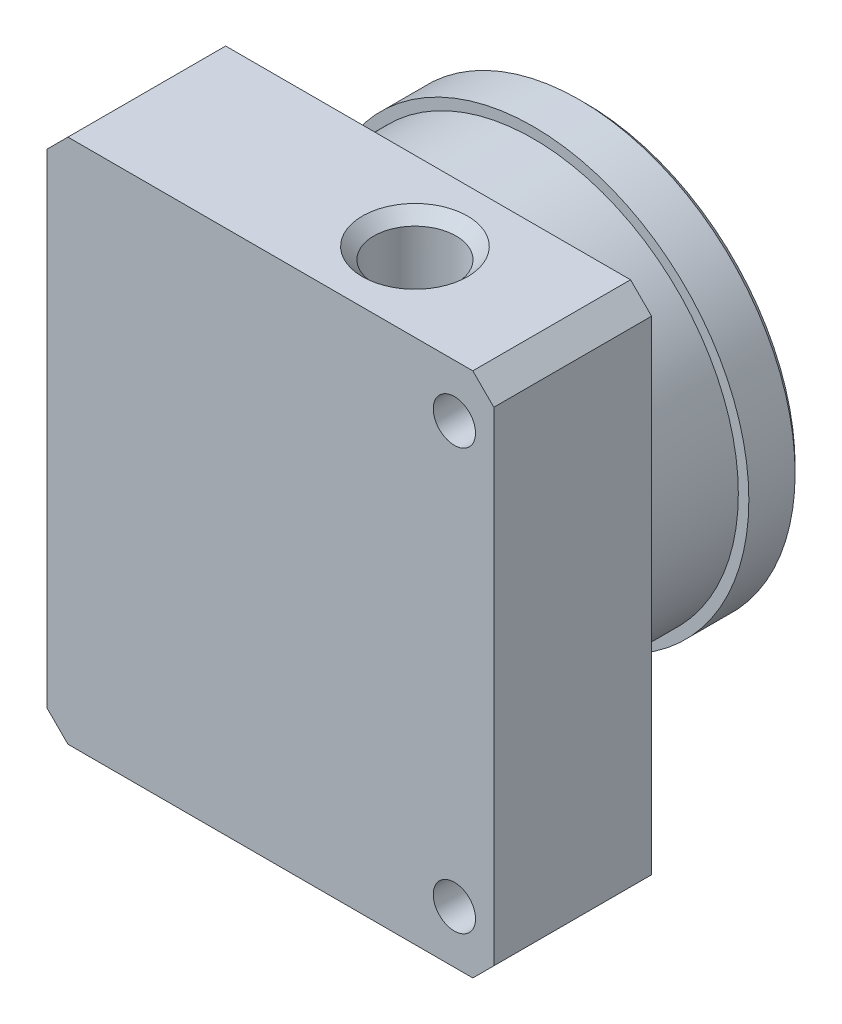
ISO-10303-21;
HEADER;
FILE_DESCRIPTION(('STEP AP214'),'2;1');
FILE_NAME('part.step','',(''),(''),'','','');
FILE_SCHEMA(('AUTOMOTIVE_DESIGN { 1 0 10303 214 1 1 1 1 }'));
ENDSEC;
DATA;
#1=APPLICATION_CONTEXT('core data for automotive mechanical design processes');
#2=APPLICATION_PROTOCOL_DEFINITION('international standard','automotive_design',2000,#1);
#3=PRODUCT_CONTEXT('',#1,'mechanical');
#4=PRODUCT('Part','Part','',(#3));
#5=PRODUCT_RELATED_PRODUCT_CATEGORY('part','',(#4));
#6=PRODUCT_DEFINITION_FORMATION('','',#4);
#7=PRODUCT_DEFINITION_CONTEXT('part definition',#1,'design');
#8=PRODUCT_DEFINITION('design','',#6,#7);
#9=PRODUCT_DEFINITION_SHAPE('','',#8);
#10=(LENGTH_UNIT() NAMED_UNIT(*) SI_UNIT(.MILLI.,.METRE.));
#11=(NAMED_UNIT(*) PLANE_ANGLE_UNIT() SI_UNIT($,.RADIAN.));
#12=(NAMED_UNIT(*) SI_UNIT($,.STERADIAN.) SOLID_ANGLE_UNIT());
#13=UNCERTAINTY_MEASURE_WITH_UNIT(LENGTH_MEASURE(1.E-05),#10,'distance_accuracy_value','');
#14=(GEOMETRIC_REPRESENTATION_CONTEXT(3) GLOBAL_UNCERTAINTY_ASSIGNED_CONTEXT((#13)) GLOBAL_UNIT_ASSIGNED_CONTEXT((#10,
#11,#12)) REPRESENTATION_CONTEXT('',''));
#15=CARTESIAN_POINT('',(0.,0.,0.));
#16=DIRECTION('',(0.,0.,1.));
#17=DIRECTION('',(1.,0.,0.));
#18=AXIS2_PLACEMENT_3D('',#15,#16,#17);
#19=CARTESIAN_POINT('',(7.93750000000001,-6.35000000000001,9.525));
#20=DIRECTION('',(0.,-1.,0.));
#21=DIRECTION('',(1.,0.,0.));
#22=AXIS2_PLACEMENT_3D('',#19,#20,#21);
#23=CYLINDRICAL_SURFACE('',#22,5.55625);
#24=CARTESIAN_POINT('',(7.93750000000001,-31.75,9.525));
#25=DIRECTION('',(0.,-1.,0.));
#26=DIRECTION('',(1.,0.,0.));
#27=AXIS2_PLACEMENT_3D('',#24,#25,#26);
#28=CIRCLE('',#27,5.55625);
#29=CARTESIAN_POINT('',(13.49375,-31.75,9.525));
#30=VERTEX_POINT('',#29);
#31=EDGE_CURVE('E306',#30,#30,#28,.T.);
#32=ORIENTED_EDGE('',*,*,#31,.T.);
#33=EDGE_LOOP('',(#32));
#34=FACE_BOUND('',#33,.T.);
#35=DIRECTION('',(0.,-1.,0.));
#36=VECTOR('',#35,1.);
#37=CARTESIAN_POINT('',(13.1569721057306,-6.35000000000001,11.43));
#38=LINE('',#37,#36);
#39=CARTESIAN_POINT('',(13.1569721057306,-9.82933484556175,11.43));
#40=VERTEX_POINT('',#39);
#41=CARTESIAN_POINT('',(13.1569721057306,-6.35000000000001,11.43));
#42=VERTEX_POINT('',#41);
#43=EDGE_CURVE('E303',#40,#42,#38,.F.);
#44=ORIENTED_EDGE('',*,*,#43,.F.);
#45=CARTESIAN_POINT('',(13.1569721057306,-9.82933484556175,11.43));
#46=CARTESIAN_POINT('',(13.2104353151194,-9.82622264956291,11.283564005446));
#47=CARTESIAN_POINT('',(13.2577046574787,-9.82298160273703,11.1348714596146));
#48=CARTESIAN_POINT('',(13.3395918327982,-9.81680380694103,10.8340348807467));
#49=CARTESIAN_POINT('',(13.3742095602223,-9.81386706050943,10.6818908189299));
#50=CARTESIAN_POINT('',(13.4305064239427,-9.80886192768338,10.3753373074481));
#51=CARTESIAN_POINT('',(13.4521958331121,-9.8067928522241,10.2209297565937));
#52=CARTESIAN_POINT('',(13.4825258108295,-9.80384809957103,9.91083426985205));
#53=CARTESIAN_POINT('',(13.491167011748,-9.80297236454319,9.75514639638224));
#54=CARTESIAN_POINT('',(13.4953395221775,-9.80255301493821,9.44344303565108));
#55=CARTESIAN_POINT('',(13.4908582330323,-9.80301068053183,9.28742737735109));
#56=CARTESIAN_POINT('',(13.4687926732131,-9.80518902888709,8.97633440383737));
#57=CARTESIAN_POINT('',(13.4512082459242,-9.80690972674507,8.82125709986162));
#58=CARTESIAN_POINT('',(13.4030796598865,-9.81133722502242,8.51325656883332));
#59=CARTESIAN_POINT('',(13.3725453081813,-9.81404327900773,8.36033180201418));
#60=CARTESIAN_POINT('',(13.2987577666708,-9.81997054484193,8.05765448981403));
#61=CARTESIAN_POINT('',(13.2555077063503,-9.8231916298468,7.90790117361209));
#62=CARTESIAN_POINT('',(13.1419182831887,-9.83045035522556,7.56882195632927));
#63=CARTESIAN_POINT('',(13.0673504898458,-9.8344479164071,7.38088359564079));
#64=CARTESIAN_POINT('',(12.9405839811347,-9.83896475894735,7.10606364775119));
#65=CARTESIAN_POINT('',(12.8958603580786,-9.84022361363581,7.01566770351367));
#66=CARTESIAN_POINT('',(12.8015478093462,-9.84199026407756,6.83741455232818));
#67=CARTESIAN_POINT('',(12.7519576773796,-9.84249787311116,6.74955798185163));
#68=CARTESIAN_POINT('',(12.7,-9.8425,6.66309367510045));
#69=B_SPLINE_CURVE_WITH_KNOTS('',3,(#45,#46,#47,#48,#49,#50,#51,#52,#53,#54,#55,#56,#57,#58,#59,
#60,#61,#62,#63,#64,#65,#66,#67,#68),.UNSPECIFIED.,.F.,.F.,(4,2,2,2,2,2,2,2,2,2,2,4),(0.,
0.467624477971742,0.93525285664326,1.40250915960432,1.86974281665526,2.33742520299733,
2.80511317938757,3.27244760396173,3.73966710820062,4.34499524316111,4.64745434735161,
4.94998861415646),.UNSPECIFIED.);
#70=CARTESIAN_POINT('',(12.7,-9.8425,6.66309367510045));
#71=VERTEX_POINT('',#70);
#72=EDGE_CURVE('E430',#40,#71,#69,.T.);
#73=ORIENTED_EDGE('',*,*,#72,.T.);
#74=CARTESIAN_POINT('',(7.93750000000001,-9.8425,9.525));
#75=DIRECTION('',(0.,-1.,0.));
#76=DIRECTION('',(0.,0.,-1.));
#77=AXIS2_PLACEMENT_3D('',#74,#75,#76);
#78=CIRCLE('',#77,5.55625);
#79=CARTESIAN_POINT('',(2.71802789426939,-9.8425,11.43));
#80=VERTEX_POINT('',#79);
#81=EDGE_CURVE('E426',#71,#80,#78,.F.);
#82=ORIENTED_EDGE('',*,*,#81,.T.);
#83=DIRECTION('',(0.,-1.,0.));
#84=VECTOR('',#83,1.);
#85=CARTESIAN_POINT('',(2.71802789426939,-6.35000000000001,11.43));
#86=LINE('',#85,#84);
#87=CARTESIAN_POINT('',(2.71802789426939,-6.35000000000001,11.43));
#88=VERTEX_POINT('',#87);
#89=EDGE_CURVE('E291',#88,#80,#86,.T.);
#90=ORIENTED_EDGE('',*,*,#89,.F.);
#91=CARTESIAN_POINT('',(7.93750000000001,-6.35000000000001,9.525));
#92=DIRECTION('',(0.,-1.,0.));
#93=DIRECTION('',(1.,0.,0.));
#94=AXIS2_PLACEMENT_3D('',#91,#92,#93);
#95=CIRCLE('',#94,5.55625);
#96=EDGE_CURVE('E307',#42,#88,#95,.T.);
#97=ORIENTED_EDGE('',*,*,#96,.F.);
#98=EDGE_LOOP('',(#44,#73,#82,#90,#97));
#99=FACE_BOUND('',#98,.T.);
#100=ADVANCED_FACE('F52',(#34,#99),#23,.F.);
#101=CARTESIAN_POINT('',(7.93750000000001,-6.35000000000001,9.525));
#102=DIRECTION('',(0.,-1.,0.));
#103=DIRECTION('',(1.,0.,0.));
#104=AXIS2_PLACEMENT_3D('',#101,#102,#103);
#105=PLANE('',#104);
#106=ORIENTED_EDGE('',*,*,#96,.T.);
#107=DIRECTION('',(1.,0.,0.));
#108=VECTOR('',#107,1.);
#109=CARTESIAN_POINT('',(7.93750000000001,-6.35000000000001,11.43));
#110=LINE('',#109,#108);
#111=EDGE_CURVE('E422',#88,#42,#110,.T.);
#112=ORIENTED_EDGE('',*,*,#111,.T.);
#113=EDGE_LOOP('',(#106,#112));
#114=FACE_BOUND('',#113,.T.);
#115=ADVANCED_FACE('F458',(#114),#105,.T.);
#116=CARTESIAN_POINT('',(-26.9875,-31.75,0.));
#117=DIRECTION('',(0.,0.,-1.));
#118=DIRECTION('',(-1.,0.,0.));
#119=AXIS2_PLACEMENT_3D('',#116,#117,#118);
#120=PLANE('',#119);
#121=CARTESIAN_POINT('',(22.225,-25.4,0.));
#122=DIRECTION('',(0.,0.,-1.));
#123=DIRECTION('',(-1.,0.,0.));
#124=AXIS2_PLACEMENT_3D('',#121,#122,#123);
#125=CIRCLE('',#124,2.5527);
#126=CARTESIAN_POINT('',(19.6723,-25.4,0.));
#127=VERTEX_POINT('',#126);
#128=EDGE_CURVE('E246',#127,#127,#125,.T.);
#129=ORIENTED_EDGE('',*,*,#128,.F.);
#130=EDGE_LOOP('',(#129));
#131=FACE_BOUND('',#130,.T.);
#132=CARTESIAN_POINT('',(22.225,25.4,0.));
#133=DIRECTION('',(0.,0.,-1.));
#134=DIRECTION('',(-1.,0.,0.));
#135=AXIS2_PLACEMENT_3D('',#132,#133,#134);
#136=CIRCLE('',#135,2.5527);
#137=CARTESIAN_POINT('',(19.6723,25.4,0.));
#138=VERTEX_POINT('',#137);
#139=EDGE_CURVE('E245',#138,#138,#136,.T.);
#140=ORIENTED_EDGE('',*,*,#139,.F.);
#141=EDGE_LOOP('',(#140));
#142=FACE_BOUND('',#141,.T.);
#143=DIRECTION('',(1.,0.,0.));
#144=VECTOR('',#143,1.);
#145=CARTESIAN_POINT('',(26.9875,-31.75,0.));
#146=LINE('',#145,#144);
#147=CARTESIAN_POINT('',(-24.4475,-31.75,0.));
#148=VERTEX_POINT('',#147);
#149=CARTESIAN_POINT('',(24.4475,-31.75,0.));
#150=VERTEX_POINT('',#149);
#151=EDGE_CURVE('E344',#148,#150,#146,.T.);
#152=ORIENTED_EDGE('',*,*,#151,.F.);
#153=DIRECTION('',(0.707106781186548,-0.707106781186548,0.));
#154=VECTOR('',#153,1.);
#155=CARTESIAN_POINT('',(-25.7175,-30.48,0.));
#156=LINE('',#155,#154);
#157=CARTESIAN_POINT('',(-26.9875,-29.21,0.));
#158=VERTEX_POINT('',#157);
#159=EDGE_CURVE('E386',#148,#158,#156,.F.);
#160=ORIENTED_EDGE('',*,*,#159,.T.);
#161=DIRECTION('',(0.,-1.,0.));
#162=VECTOR('',#161,1.);
#163=CARTESIAN_POINT('',(-26.9875,31.75,0.));
#164=LINE('',#163,#162);
#165=CARTESIAN_POINT('',(-26.9875,29.21,0.));
#166=VERTEX_POINT('',#165);
#167=EDGE_CURVE('E322',#166,#158,#164,.T.);
#168=ORIENTED_EDGE('',*,*,#167,.F.);
#169=DIRECTION('',(-0.707106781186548,-0.707106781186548,0.));
#170=VECTOR('',#169,1.);
#171=CARTESIAN_POINT('',(-57.4675,-1.27000000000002,0.));
#172=LINE('',#171,#170);
#173=CARTESIAN_POINT('',(-24.4475,31.75,0.));
#174=VERTEX_POINT('',#173);
#175=EDGE_CURVE('E377',#166,#174,#172,.F.);
#176=ORIENTED_EDGE('',*,*,#175,.T.);
#177=DIRECTION('',(-1.,0.,0.));
#178=VECTOR('',#177,1.);
#179=CARTESIAN_POINT('',(-26.9875,31.75,0.));
#180=LINE('',#179,#178);
#181=CARTESIAN_POINT('',(24.4475,31.75,0.));
#182=VERTEX_POINT('',#181);
#183=EDGE_CURVE('E328',#182,#174,#180,.T.);
#184=ORIENTED_EDGE('',*,*,#183,.F.);
#185=DIRECTION('',(-0.707106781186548,0.707106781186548,0.));
#186=VECTOR('',#185,1.);
#187=CARTESIAN_POINT('',(30.48,25.7175,0.));
#188=LINE('',#187,#186);
#189=CARTESIAN_POINT('',(26.9875,29.21,0.));
#190=VERTEX_POINT('',#189);
#191=EDGE_CURVE('E380',#182,#190,#188,.F.);
#192=ORIENTED_EDGE('',*,*,#191,.T.);
#193=DIRECTION('',(0.,1.,0.));
#194=VECTOR('',#193,1.);
#195=CARTESIAN_POINT('',(26.9875,31.75,0.));
#196=LINE('',#195,#194);
#197=CARTESIAN_POINT('',(26.9875,-29.21,0.));
#198=VERTEX_POINT('',#197);
#199=EDGE_CURVE('E348',#198,#190,#196,.T.);
#200=ORIENTED_EDGE('',*,*,#199,.F.);
#201=DIRECTION('',(0.707106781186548,0.707106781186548,0.));
#202=VECTOR('',#201,1.);
#203=CARTESIAN_POINT('',(-1.27000000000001,-57.4675,0.));
#204=LINE('',#203,#202);
#205=EDGE_CURVE('E383',#198,#150,#204,.F.);
#206=ORIENTED_EDGE('',*,*,#205,.T.);
#207=EDGE_LOOP('',(#152,#160,#168,#176,#184,#192,#200,#206));
#208=FACE_BOUND('',#207,.T.);
#209=CARTESIAN_POINT('',(0.,3.175,0.));
#210=DIRECTION('',(0.,0.,-1.));
#211=DIRECTION('',(-1.,0.,0.));
#212=AXIS2_PLACEMENT_3D('',#209,#210,#211);
#213=CIRCLE('',#212,24.765);
#214=CARTESIAN_POINT('',(-24.765,3.175,0.));
#215=VERTEX_POINT('',#214);
#216=EDGE_CURVE('E232',#215,#215,#213,.T.);
#217=ORIENTED_EDGE('',*,*,#216,.F.);
#218=EDGE_LOOP('',(#217));
#219=FACE_BOUND('',#218,.T.);
#220=ADVANCED_FACE('F460',(#131,#142,#208,#219),#120,.T.);
#221=CARTESIAN_POINT('',(-26.9875,31.75,19.05));
#222=DIRECTION('',(1.,0.,0.));
#223=DIRECTION('',(0.,1.,0.));
#224=AXIS2_PLACEMENT_3D('',#221,#222,#223);
#225=PLANE('',#224);
#226=CARTESIAN_POINT('',(-26.9875,19.05,9.525));
#227=DIRECTION('',(-1.,0.,0.));
#228=DIRECTION('',(0.,0.,1.));
#229=AXIS2_PLACEMENT_3D('',#226,#227,#228);
#230=CIRCLE('',#229,6.35);
#231=CARTESIAN_POINT('',(-26.9875,19.05,15.875));
#232=VERTEX_POINT('',#231);
#233=EDGE_CURVE('E189',#232,#232,#230,.T.);
#234=ORIENTED_EDGE('',*,*,#233,.F.);
#235=EDGE_LOOP('',(#234));
#236=FACE_BOUND('',#235,.T.);
#237=ORIENTED_EDGE('',*,*,#167,.T.);
#238=DIRECTION('',(0.,0.,1.));
#239=VECTOR('',#238,1.);
#240=CARTESIAN_POINT('',(-26.9875,-29.21,19.05));
#241=LINE('',#240,#239);
#242=CARTESIAN_POINT('',(-26.9875,-29.21,19.05));
#243=VERTEX_POINT('',#242);
#244=EDGE_CURVE('E393',#158,#243,#241,.T.);
#245=ORIENTED_EDGE('',*,*,#244,.T.);
#246=DIRECTION('',(0.,-1.,0.));
#247=VECTOR('',#246,1.);
#248=CARTESIAN_POINT('',(-26.9875,31.75,19.05));
#249=LINE('',#248,#247);
#250=CARTESIAN_POINT('',(-26.9875,29.21,19.05));
#251=VERTEX_POINT('',#250);
#252=EDGE_CURVE('E323',#251,#243,#249,.T.);
#253=ORIENTED_EDGE('',*,*,#252,.F.);
#254=DIRECTION('',(0.,0.,-1.));
#255=VECTOR('',#254,1.);
#256=CARTESIAN_POINT('',(-26.9875,29.21,19.05));
#257=LINE('',#256,#255);
#258=EDGE_CURVE('E389',#251,#166,#257,.T.);
#259=ORIENTED_EDGE('',*,*,#258,.T.);
#260=EDGE_LOOP('',(#237,#245,#253,#259));
#261=FACE_BOUND('',#260,.T.);
#262=ADVANCED_FACE('F466',(#236,#261),#225,.F.);
#263=CARTESIAN_POINT('',(26.9875,-31.75,19.05));
#264=DIRECTION('',(0.,1.,0.));
#265=DIRECTION('',(-1.,0.,0.));
#266=AXIS2_PLACEMENT_3D('',#263,#264,#265);
#267=PLANE('',#266);
#268=CARTESIAN_POINT('',(-14.2875,-31.75,9.525));
#269=DIRECTION('',(0.,-1.,0.));
#270=DIRECTION('',(1.,0.,0.));
#271=AXIS2_PLACEMENT_3D('',#268,#269,#270);
#272=CIRCLE('',#271,3.4925);
#273=CARTESIAN_POINT('',(-10.795,-31.75,9.525));
#274=VERTEX_POINT('',#273);
#275=EDGE_CURVE('E213',#274,#274,#272,.T.);
#276=ORIENTED_EDGE('',*,*,#275,.F.);
#277=EDGE_LOOP('',(#276));
#278=FACE_BOUND('',#277,.T.);
#279=ORIENTED_EDGE('',*,*,#31,.F.);
#280=EDGE_LOOP('',(#279));
#281=FACE_BOUND('',#280,.T.);
#282=DIRECTION('',(1.,0.,0.));
#283=VECTOR('',#282,1.);
#284=CARTESIAN_POINT('',(26.9875,-31.75,19.05));
#285=LINE('',#284,#283);
#286=CARTESIAN_POINT('',(-24.4475,-31.75,19.05));
#287=VERTEX_POINT('',#286);
#288=CARTESIAN_POINT('',(24.4475,-31.75,19.05));
#289=VERTEX_POINT('',#288);
#290=EDGE_CURVE('E327',#287,#289,#285,.T.);
#291=ORIENTED_EDGE('',*,*,#290,.F.);
#292=DIRECTION('',(0.,0.,-1.));
#293=VECTOR('',#292,1.);
#294=CARTESIAN_POINT('',(-24.4475,-31.75,19.05));
#295=LINE('',#294,#293);
#296=EDGE_CURVE('E373',#287,#148,#295,.T.);
#297=ORIENTED_EDGE('',*,*,#296,.T.);
#298=ORIENTED_EDGE('',*,*,#151,.T.);
#299=DIRECTION('',(0.,0.,1.));
#300=VECTOR('',#299,1.);
#301=CARTESIAN_POINT('',(24.4475,-31.75,19.05));
#302=LINE('',#301,#300);
#303=EDGE_CURVE('E370',#150,#289,#302,.T.);
#304=ORIENTED_EDGE('',*,*,#303,.T.);
#305=EDGE_LOOP('',(#291,#297,#298,#304));
#306=FACE_BOUND('',#305,.T.);
#307=ADVANCED_FACE('F603',(#278,#281,#306),#267,.F.);
#308=CARTESIAN_POINT('',(26.9875,31.75,19.05));
#309=DIRECTION('',(-1.,0.,0.));
#310=DIRECTION('',(0.,-1.,0.));
#311=AXIS2_PLACEMENT_3D('',#308,#309,#310);
#312=PLANE('',#311);
#313=DIRECTION('',(0.,1.,0.));
#314=VECTOR('',#313,1.);
#315=CARTESIAN_POINT('',(26.9875,31.75,19.05));
#316=LINE('',#315,#314);
#317=CARTESIAN_POINT('',(26.9875,-29.21,19.05));
#318=VERTEX_POINT('',#317);
#319=CARTESIAN_POINT('',(26.9875,29.21,19.05));
#320=VERTEX_POINT('',#319);
#321=EDGE_CURVE('E332',#318,#320,#316,.T.);
#322=ORIENTED_EDGE('',*,*,#321,.F.);
#323=DIRECTION('',(0.,0.,-1.));
#324=VECTOR('',#323,1.);
#325=CARTESIAN_POINT('',(26.9875,-29.21,19.05));
#326=LINE('',#325,#324);
#327=EDGE_CURVE('E411',#318,#198,#326,.T.);
#328=ORIENTED_EDGE('',*,*,#327,.T.);
#329=ORIENTED_EDGE('',*,*,#199,.T.);
#330=DIRECTION('',(0.,0.,1.));
#331=VECTOR('',#330,1.);
#332=CARTESIAN_POINT('',(26.9875,29.21,19.05));
#333=LINE('',#332,#331);
#334=EDGE_CURVE('E408',#190,#320,#333,.T.);
#335=ORIENTED_EDGE('',*,*,#334,.T.);
#336=EDGE_LOOP('',(#322,#328,#329,#335));
#337=FACE_BOUND('',#336,.T.);
#338=ADVANCED_FACE('F599',(#337),#312,.F.);
#339=CARTESIAN_POINT('',(-26.9875,31.75,19.05));
#340=DIRECTION('',(0.,-1.,0.));
#341=DIRECTION('',(1.,0.,0.));
#342=AXIS2_PLACEMENT_3D('',#339,#340,#341);
#343=PLANE('',#342);
#344=CARTESIAN_POINT('',(7.9375,31.75,9.525));
#345=DIRECTION('',(0.,1.,0.));
#346=DIRECTION('',(0.,0.,1.));
#347=AXIS2_PLACEMENT_3D('',#344,#345,#346);
#348=CIRCLE('',#347,6.35);
#349=CARTESIAN_POINT('',(7.9375,31.75,15.875));
#350=VERTEX_POINT('',#349);
#351=EDGE_CURVE('E192',#350,#350,#348,.T.);
#352=ORIENTED_EDGE('',*,*,#351,.F.);
#353=EDGE_LOOP('',(#352));
#354=FACE_BOUND('',#353,.T.);
#355=DIRECTION('',(-1.,0.,0.));
#356=VECTOR('',#355,1.);
#357=CARTESIAN_POINT('',(-26.9875,31.75,19.05));
#358=LINE('',#357,#356);
#359=CARTESIAN_POINT('',(24.4475,31.75,19.05));
#360=VERTEX_POINT('',#359);
#361=CARTESIAN_POINT('',(-24.4475,31.75,19.05));
#362=VERTEX_POINT('',#361);
#363=EDGE_CURVE('E336',#360,#362,#358,.T.);
#364=ORIENTED_EDGE('',*,*,#363,.F.);
#365=DIRECTION('',(0.,0.,-1.));
#366=VECTOR('',#365,1.);
#367=CARTESIAN_POINT('',(24.4475,31.75,19.05));
#368=LINE('',#367,#366);
#369=EDGE_CURVE('E418',#360,#182,#368,.T.);
#370=ORIENTED_EDGE('',*,*,#369,.T.);
#371=ORIENTED_EDGE('',*,*,#183,.T.);
#372=DIRECTION('',(0.,0.,1.));
#373=VECTOR('',#372,1.);
#374=CARTESIAN_POINT('',(-24.4475,31.75,19.05));
#375=LINE('',#374,#373);
#376=EDGE_CURVE('E415',#174,#362,#375,.T.);
#377=ORIENTED_EDGE('',*,*,#376,.T.);
#378=EDGE_LOOP('',(#364,#370,#371,#377));
#379=FACE_BOUND('',#378,.T.);
#380=ADVANCED_FACE('F594',(#354,#379),#343,.F.);
#381=CARTESIAN_POINT('',(-26.9875,-31.75,19.05));
#382=DIRECTION('',(0.,0.,-1.));
#383=DIRECTION('',(-1.,0.,0.));
#384=AXIS2_PLACEMENT_3D('',#381,#382,#383);
#385=PLANE('',#384);
#386=CARTESIAN_POINT('',(22.225,-25.4,19.05));
#387=DIRECTION('',(0.,0.,-1.));
#388=DIRECTION('',(-1.,0.,0.));
#389=AXIS2_PLACEMENT_3D('',#386,#387,#388);
#390=CIRCLE('',#389,2.5527);
#391=CARTESIAN_POINT('',(19.6723,-25.4,19.05));
#392=VERTEX_POINT('',#391);
#393=EDGE_CURVE('E241',#392,#392,#390,.T.);
#394=ORIENTED_EDGE('',*,*,#393,.T.);
#395=EDGE_LOOP('',(#394));
#396=FACE_BOUND('',#395,.T.);
#397=CARTESIAN_POINT('',(22.225,25.4,19.05));
#398=DIRECTION('',(0.,0.,-1.));
#399=DIRECTION('',(-1.,0.,0.));
#400=AXIS2_PLACEMENT_3D('',#397,#398,#399);
#401=CIRCLE('',#400,2.5527);
#402=CARTESIAN_POINT('',(19.6723,25.4,19.05));
#403=VERTEX_POINT('',#402);
#404=EDGE_CURVE('E250',#403,#403,#401,.T.);
#405=ORIENTED_EDGE('',*,*,#404,.T.);
#406=EDGE_LOOP('',(#405));
#407=FACE_BOUND('',#406,.T.);
#408=ORIENTED_EDGE('',*,*,#252,.T.);
#409=DIRECTION('',(-0.707106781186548,0.707106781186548,0.));
#410=VECTOR('',#409,1.);
#411=CARTESIAN_POINT('',(-24.4475,-31.75,19.05));
#412=LINE('',#411,#410);
#413=EDGE_CURVE('E405',#243,#287,#412,.F.);
#414=ORIENTED_EDGE('',*,*,#413,.T.);
#415=ORIENTED_EDGE('',*,*,#290,.T.);
#416=DIRECTION('',(-0.707106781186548,-0.707106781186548,0.));
#417=VECTOR('',#416,1.);
#418=CARTESIAN_POINT('',(26.9875,-29.21,19.05));
#419=LINE('',#418,#417);
#420=EDGE_CURVE('E402',#289,#318,#419,.F.);
#421=ORIENTED_EDGE('',*,*,#420,.T.);
#422=ORIENTED_EDGE('',*,*,#321,.T.);
#423=DIRECTION('',(0.707106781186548,-0.707106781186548,0.));
#424=VECTOR('',#423,1.);
#425=CARTESIAN_POINT('',(24.4475,31.75,19.05));
#426=LINE('',#425,#424);
#427=EDGE_CURVE('E399',#320,#360,#426,.F.);
#428=ORIENTED_EDGE('',*,*,#427,.T.);
#429=ORIENTED_EDGE('',*,*,#363,.T.);
#430=DIRECTION('',(0.707106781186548,0.707106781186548,0.));
#431=VECTOR('',#430,1.);
#432=CARTESIAN_POINT('',(-26.9875,29.21,19.05));
#433=LINE('',#432,#431);
#434=EDGE_CURVE('E396',#362,#251,#433,.F.);
#435=ORIENTED_EDGE('',*,*,#434,.T.);
#436=EDGE_LOOP('',(#408,#414,#415,#421,#422,#428,#429,#435));
#437=FACE_BOUND('',#436,.T.);
#438=ADVANCED_FACE('F591',(#396,#407,#437),#385,.F.);
#439=CARTESIAN_POINT('',(0.,3.175,-19.05));
#440=DIRECTION('',(0.,0.,-1.));
#441=DIRECTION('',(-1.,0.,0.));
#442=AXIS2_PLACEMENT_3D('',#439,#440,#441);
#443=PLANE('',#442);
#444=CARTESIAN_POINT('',(0.,3.175,-19.05));
#445=DIRECTION('',(0.,0.,-1.));
#446=DIRECTION('',(-1.,0.,0.));
#447=AXIS2_PLACEMENT_3D('',#444,#445,#446);
#448=CIRCLE('',#447,22.987);
#449=CARTESIAN_POINT('',(-22.987,3.175,-19.05));
#450=VERTEX_POINT('',#449);
#451=EDGE_CURVE('E362',#450,#450,#448,.F.);
#452=ORIENTED_EDGE('',*,*,#451,.T.);
#453=EDGE_LOOP('',(#452));
#454=FACE_BOUND('',#453,.T.);
#455=CARTESIAN_POINT('',(0.,3.175,-19.05));
#456=DIRECTION('',(0.,0.,-1.));
#457=DIRECTION('',(-1.,0.,0.));
#458=AXIS2_PLACEMENT_3D('',#455,#456,#457);
#459=CIRCLE('',#458,25.273);
#460=CARTESIAN_POINT('',(25.273,3.175,-19.05));
#461=VERTEX_POINT('',#460);
#462=EDGE_CURVE('E358',#461,#461,#459,.T.);
#463=ORIENTED_EDGE('',*,*,#462,.T.);
#464=EDGE_LOOP('',(#463));
#465=FACE_BOUND('',#464,.T.);
#466=ADVANCED_FACE('F593',(#454,#465),#443,.T.);
#467=CARTESIAN_POINT('',(0.,3.175,-19.05));
#468=DIRECTION('',(0.,0.,1.));
#469=DIRECTION('',(1.,0.,0.));
#470=AXIS2_PLACEMENT_3D('',#467,#468,#469);
#471=CYLINDRICAL_SURFACE('',#470,26.035);
#472=CARTESIAN_POINT('',(0.,3.175,-12.7));
#473=DIRECTION('',(0.,0.,-1.));
#474=DIRECTION('',(-1.,0.,0.));
#475=AXIS2_PLACEMENT_3D('',#472,#473,#474);
#476=CIRCLE('',#475,26.035);
#477=CARTESIAN_POINT('',(26.035,3.175,-12.7));
#478=VERTEX_POINT('',#477);
#479=EDGE_CURVE('E224',#478,#478,#476,.T.);
#480=CARTESIAN_POINT('',(0.,3.175,-18.288));
#481=DIRECTION('',(0.,0.,-1.));
#482=DIRECTION('',(-1.,0.,0.));
#483=AXIS2_PLACEMENT_3D('',#480,#481,#482);
#484=CIRCLE('',#483,26.035);
#485=CARTESIAN_POINT('',(26.035,3.175,-18.288));
#486=VERTEX_POINT('',#485);
#487=EDGE_CURVE('E366',#486,#486,#484,.F.);
#488=CARTESIAN_POINT('',(26.035,3.175,-12.7));
#489=CARTESIAN_POINT('',(26.035,3.175,-12.7582083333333));
#490=CARTESIAN_POINT('',(26.035,3.175,-12.8164166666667));
#491=CARTESIAN_POINT('',(26.035,3.175,-12.9328333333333));
#492=CARTESIAN_POINT('',(26.035,3.175,-12.9910416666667));
#493=CARTESIAN_POINT('',(26.035,3.175,-13.1074583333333));
#494=CARTESIAN_POINT('',(26.035,3.175,-13.1656666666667));
#495=CARTESIAN_POINT('',(26.035,3.175,-13.2820833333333));
#496=CARTESIAN_POINT('',(26.035,3.175,-13.3402916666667));
#497=CARTESIAN_POINT('',(26.035,3.175,-13.4567083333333));
#498=CARTESIAN_POINT('',(26.035,3.175,-13.5149166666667));
#499=CARTESIAN_POINT('',(26.035,3.175,-13.6313333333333));
#500=CARTESIAN_POINT('',(26.035,3.175,-13.6895416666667));
#501=CARTESIAN_POINT('',(26.035,3.175,-13.8059583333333));
#502=CARTESIAN_POINT('',(26.035,3.175,-13.8641666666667));
#503=CARTESIAN_POINT('',(26.035,3.175,-13.9805833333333));
#504=CARTESIAN_POINT('',(26.035,3.175,-14.0387916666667));
#505=CARTESIAN_POINT('',(26.035,3.175,-14.1552083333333));
#506=CARTESIAN_POINT('',(26.035,3.175,-14.2134166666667));
#507=CARTESIAN_POINT('',(26.035,3.175,-14.3298333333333));
#508=CARTESIAN_POINT('',(26.035,3.175,-14.3880416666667));
#509=CARTESIAN_POINT('',(26.035,3.175,-14.5044583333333));
#510=CARTESIAN_POINT('',(26.035,3.175,-14.5626666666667));
#511=CARTESIAN_POINT('',(26.035,3.175,-14.6790833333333));
#512=CARTESIAN_POINT('',(26.035,3.175,-14.7372916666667));
#513=CARTESIAN_POINT('',(26.035,3.175,-14.8537083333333));
#514=CARTESIAN_POINT('',(26.035,3.175,-14.9119166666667));
#515=CARTESIAN_POINT('',(26.035,3.175,-15.0283333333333));
#516=CARTESIAN_POINT('',(26.035,3.175,-15.0865416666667));
#517=CARTESIAN_POINT('',(26.035,3.175,-15.2029583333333));
#518=CARTESIAN_POINT('',(26.035,3.175,-15.2611666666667));
#519=CARTESIAN_POINT('',(26.035,3.175,-15.3775833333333));
#520=CARTESIAN_POINT('',(26.035,3.175,-15.4357916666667));
#521=CARTESIAN_POINT('',(26.035,3.175,-15.5522083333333));
#522=CARTESIAN_POINT('',(26.035,3.175,-15.6104166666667));
#523=CARTESIAN_POINT('',(26.035,3.175,-15.7268333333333));
#524=CARTESIAN_POINT('',(26.035,3.175,-15.7850416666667));
#525=CARTESIAN_POINT('',(26.035,3.175,-15.9014583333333));
#526=CARTESIAN_POINT('',(26.035,3.175,-15.9596666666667));
#527=CARTESIAN_POINT('',(26.035,3.175,-16.0760833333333));
#528=CARTESIAN_POINT('',(26.035,3.175,-16.1342916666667));
#529=CARTESIAN_POINT('',(26.035,3.175,-16.2507083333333));
#530=CARTESIAN_POINT('',(26.035,3.175,-16.3089166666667));
#531=CARTESIAN_POINT('',(26.035,3.175,-16.4253333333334));
#532=CARTESIAN_POINT('',(26.035,3.175,-16.4835416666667));
#533=CARTESIAN_POINT('',(26.035,3.175,-16.5999583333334));
#534=CARTESIAN_POINT('',(26.035,3.175,-16.6581666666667));
#535=CARTESIAN_POINT('',(26.035,3.175,-16.7745833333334));
#536=CARTESIAN_POINT('',(26.035,3.175,-16.8327916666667));
#537=CARTESIAN_POINT('',(26.035,3.175,-16.9492083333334));
#538=CARTESIAN_POINT('',(26.035,3.175,-17.0074166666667));
#539=CARTESIAN_POINT('',(26.035,3.175,-17.1238333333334));
#540=CARTESIAN_POINT('',(26.035,3.175,-17.1820416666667));
#541=CARTESIAN_POINT('',(26.035,3.175,-17.2984583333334));
#542=CARTESIAN_POINT('',(26.035,3.175,-17.3566666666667));
#543=CARTESIAN_POINT('',(26.035,3.175,-17.4730833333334));
#544=CARTESIAN_POINT('',(26.035,3.175,-17.5312916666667));
#545=CARTESIAN_POINT('',(26.035,3.175,-17.6477083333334));
#546=CARTESIAN_POINT('',(26.035,3.175,-17.7059166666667));
#547=CARTESIAN_POINT('',(26.035,3.175,-17.8223333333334));
#548=CARTESIAN_POINT('',(26.035,3.175,-17.8805416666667));
#549=CARTESIAN_POINT('',(26.035,3.175,-17.9969583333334));
#550=CARTESIAN_POINT('',(26.035,3.175,-18.0551666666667));
#551=CARTESIAN_POINT('',(26.035,3.175,-18.1715833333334));
#552=CARTESIAN_POINT('',(26.035,3.175,-18.2297916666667));
#553=CARTESIAN_POINT('',(26.035,3.175,-18.288));
#554=B_SPLINE_CURVE_WITH_KNOTS('',3,(#488,#489,#490,#491,#492,#493,#494,#495,#496,#497,#498,
#499,#500,#501,#502,#503,#504,#505,#506,#507,#508,#509,#510,#511,#512,#513,#514,#515,#516,#517,
#518,#519,#520,#521,#522,#523,#524,#525,#526,#527,#528,#529,#530,#531,#532,#533,#534,#535,#536,
#537,#538,#539,#540,#541,#542,#543,#544,#545,#546,#547,#548,#549,#550,#551,#552,#553),
.UNSPECIFIED.,.F.,.F.,(4,2,2,2,2,2,2,2,2,2,2,2,2,2,2,2,2,2,2,2,2,2,2,2,2,2,2,2,2,2,2,2,4),(0.,
0.174625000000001,0.349250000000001,0.523875,0.698500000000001,0.873125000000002,1.04775,
1.222375,1.39700000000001,1.57162500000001,1.74625000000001,1.92087500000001,2.09550000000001,
2.27012500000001,2.44475000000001,2.61937500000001,2.79400000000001,2.96862500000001,
3.14325000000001,3.31787500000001,3.49250000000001,3.66712500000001,3.84175000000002,
4.01637500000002,4.19100000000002,4.36562500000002,4.54025000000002,4.71487500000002,
4.88950000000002,5.06412500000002,5.23875000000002,5.41337500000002,5.58800000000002),.UNSPECIFIED.);
#555=EDGE_CURVE('BSEAM667',#478,#486,#554,.T.);
#556=ORIENTED_EDGE('',*,*,#479,.T.);
#557=ORIENTED_EDGE('',*,*,#487,.T.);
#558=ORIENTED_EDGE('',*,*,#555,.T.);
#559=ORIENTED_EDGE('',*,*,#555,.F.);
#560=EDGE_LOOP('',(#556,#558,#557,#559));
#561=FACE_BOUND('',#560,.T.);
#562=ADVANCED_FACE('F667',(#561),#471,.T.);
#563=CARTESIAN_POINT('',(0.,3.175,-19.05));
#564=DIRECTION('',(0.,0.,1.));
#565=DIRECTION('',(1.,0.,0.));
#566=AXIS2_PLACEMENT_3D('',#563,#564,#565);
#567=CYLINDRICAL_SURFACE('',#566,22.225);
#568=CARTESIAN_POINT('',(0.,3.175,-18.288));
#569=DIRECTION('',(0.,0.,-1.));
#570=DIRECTION('',(-1.,0.,0.));
#571=AXIS2_PLACEMENT_3D('',#568,#569,#570);
#572=CIRCLE('',#571,22.225);
#573=CARTESIAN_POINT('',(22.225,3.175,-18.288));
#574=VERTEX_POINT('',#573);
#575=EDGE_CURVE('E340',#574,#574,#572,.T.);
#576=CARTESIAN_POINT('',(0.,3.175,1.27));
#577=DIRECTION('',(0.,0.,-1.));
#578=DIRECTION('',(-1.,0.,0.));
#579=AXIS2_PLACEMENT_3D('',#576,#577,#578);
#580=CIRCLE('',#579,22.225);
#581=CARTESIAN_POINT('',(22.225,3.175,1.27));
#582=VERTEX_POINT('',#581);
#583=EDGE_CURVE('E311',#582,#582,#580,.T.);
#584=CARTESIAN_POINT('',(22.225,3.175,-18.288));
#585=CARTESIAN_POINT('',(22.225,3.175,-18.0842708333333));
#586=CARTESIAN_POINT('',(22.225,3.175,-17.8805416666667));
#587=CARTESIAN_POINT('',(22.225,3.175,-17.4730833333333));
#588=CARTESIAN_POINT('',(22.225,3.175,-17.2693541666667));
#589=CARTESIAN_POINT('',(22.225,3.175,-16.8618958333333));
#590=CARTESIAN_POINT('',(22.225,3.175,-16.6581666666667));
#591=CARTESIAN_POINT('',(22.225,3.175,-16.2507083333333));
#592=CARTESIAN_POINT('',(22.225,3.175,-16.0469791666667));
#593=CARTESIAN_POINT('',(22.225,3.175,-15.6395208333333));
#594=CARTESIAN_POINT('',(22.225,3.175,-15.4357916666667));
#595=CARTESIAN_POINT('',(22.225,3.175,-15.0283333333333));
#596=CARTESIAN_POINT('',(22.225,3.175,-14.8246041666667));
#597=CARTESIAN_POINT('',(22.225,3.175,-14.4171458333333));
#598=CARTESIAN_POINT('',(22.225,3.175,-14.2134166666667));
#599=CARTESIAN_POINT('',(22.225,3.175,-13.8059583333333));
#600=CARTESIAN_POINT('',(22.225,3.175,-13.6022291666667));
#601=CARTESIAN_POINT('',(22.225,3.175,-13.1947708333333));
#602=CARTESIAN_POINT('',(22.225,3.175,-12.9910416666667));
#603=CARTESIAN_POINT('',(22.225,3.175,-12.5835833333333));
#604=CARTESIAN_POINT('',(22.225,3.175,-12.3798541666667));
#605=CARTESIAN_POINT('',(22.225,3.175,-11.9723958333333));
#606=CARTESIAN_POINT('',(22.225,3.175,-11.7686666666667));
#607=CARTESIAN_POINT('',(22.225,3.175,-11.3612083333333));
#608=CARTESIAN_POINT('',(22.225,3.175,-11.1574791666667));
#609=CARTESIAN_POINT('',(22.225,3.175,-10.7500208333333));
#610=CARTESIAN_POINT('',(22.225,3.175,-10.5462916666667));
#611=CARTESIAN_POINT('',(22.225,3.175,-10.1388333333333));
#612=CARTESIAN_POINT('',(22.225,3.175,-9.93510416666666));
#613=CARTESIAN_POINT('',(22.225,3.175,-9.52764583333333));
#614=CARTESIAN_POINT('',(22.225,3.175,-9.32391666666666));
#615=CARTESIAN_POINT('',(22.225,3.175,-8.91645833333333));
#616=CARTESIAN_POINT('',(22.225,3.175,-8.71272916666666));
#617=CARTESIAN_POINT('',(22.225,3.175,-8.30527083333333));
#618=CARTESIAN_POINT('',(22.225,3.175,-8.10154166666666));
#619=CARTESIAN_POINT('',(22.225,3.175,-7.69408333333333));
#620=CARTESIAN_POINT('',(22.225,3.175,-7.49035416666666));
#621=CARTESIAN_POINT('',(22.225,3.175,-7.08289583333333));
#622=CARTESIAN_POINT('',(22.225,3.175,-6.87916666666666));
#623=CARTESIAN_POINT('',(22.225,3.175,-6.47170833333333));
#624=CARTESIAN_POINT('',(22.225,3.175,-6.26797916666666));
#625=CARTESIAN_POINT('',(22.225,3.175,-5.86052083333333));
#626=CARTESIAN_POINT('',(22.225,3.175,-5.65679166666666));
#627=CARTESIAN_POINT('',(22.225,3.175,-5.24933333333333));
#628=CARTESIAN_POINT('',(22.225,3.175,-5.04560416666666));
#629=CARTESIAN_POINT('',(22.225,3.175,-4.63814583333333));
#630=CARTESIAN_POINT('',(22.225,3.175,-4.43441666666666));
#631=CARTESIAN_POINT('',(22.225,3.175,-4.02695833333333));
#632=CARTESIAN_POINT('',(22.225,3.175,-3.82322916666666));
#633=CARTESIAN_POINT('',(22.225,3.175,-3.41577083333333));
#634=CARTESIAN_POINT('',(22.225,3.175,-3.21204166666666));
#635=CARTESIAN_POINT('',(22.225,3.175,-2.80458333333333));
#636=CARTESIAN_POINT('',(22.225,3.175,-2.60085416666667));
#637=CARTESIAN_POINT('',(22.225,3.175,-2.19339583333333));
#638=CARTESIAN_POINT('',(22.225,3.175,-1.98966666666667));
#639=CARTESIAN_POINT('',(22.225,3.175,-1.58220833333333));
#640=CARTESIAN_POINT('',(22.225,3.175,-1.37847916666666));
#641=CARTESIAN_POINT('',(22.225,3.175,-0.971020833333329));
#642=CARTESIAN_POINT('',(22.225,3.175,-0.767291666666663));
#643=CARTESIAN_POINT('',(22.225,3.175,-0.35983333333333));
#644=CARTESIAN_POINT('',(22.225,3.175,-0.156104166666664));
#645=CARTESIAN_POINT('',(22.225,3.175,0.251354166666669));
#646=CARTESIAN_POINT('',(22.225,3.175,0.455083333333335));
#647=CARTESIAN_POINT('',(22.225,3.175,0.862541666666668));
#648=CARTESIAN_POINT('',(22.225,3.175,1.06627083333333));
#649=CARTESIAN_POINT('',(22.225,3.175,1.27));
#650=B_SPLINE_CURVE_WITH_KNOTS('',3,(#584,#585,#586,#587,#588,#589,#590,#591,#592,#593,#594,
#595,#596,#597,#598,#599,#600,#601,#602,#603,#604,#605,#606,#607,#608,#609,#610,#611,#612,#613,
#614,#615,#616,#617,#618,#619,#620,#621,#622,#623,#624,#625,#626,#627,#628,#629,#630,#631,#632,
#633,#634,#635,#636,#637,#638,#639,#640,#641,#642,#643,#644,#645,#646,#647,#648,#649),
.UNSPECIFIED.,.F.,.F.,(4,2,2,2,2,2,2,2,2,2,2,2,2,2,2,2,2,2,2,2,2,2,2,2,2,2,2,2,2,2,2,2,4),(0.,
0.611187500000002,1.222375,1.8335625,2.44475,3.0559375,3.667125,4.2783125,4.8895,5.5006875,
6.111875,6.7230625,7.33425,7.9454375,8.556625,9.1678125,9.779,10.3901875,11.001375,11.6125625,
12.22375,12.8349375,13.446125,14.0573125,14.6685,15.2796875,15.890875,16.5020625,17.11325,
17.7244375,18.335625,18.9468125,19.558),.UNSPECIFIED.);
#651=EDGE_CURVE('BSEAM615',#574,#582,#650,.T.);
#652=ORIENTED_EDGE('',*,*,#575,.T.);
#653=ORIENTED_EDGE('',*,*,#583,.F.);
#654=ORIENTED_EDGE('',*,*,#651,.T.);
#655=ORIENTED_EDGE('',*,*,#651,.F.);
#656=EDGE_LOOP('',(#652,#654,#653,#655));
#657=FACE_BOUND('',#656,.T.);
#658=ADVANCED_FACE('F615',(#657),#567,.F.);
#659=CARTESIAN_POINT('',(0.,3.175,-18.288));
#660=DIRECTION('',(0.,0.,-1.));
#661=DIRECTION('',(-1.,0.,0.));
#662=AXIS2_PLACEMENT_3D('',#659,#660,#661);
#663=CONICAL_SURFACE('',#662,22.225,0.785398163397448);
#664=ORIENTED_EDGE('',*,*,#451,.F.);
#665=EDGE_LOOP('',(#664));
#666=FACE_BOUND('',#665,.T.);
#667=ORIENTED_EDGE('',*,*,#575,.F.);
#668=EDGE_LOOP('',(#667));
#669=FACE_BOUND('',#668,.T.);
#670=ADVANCED_FACE('F611',(#666,#669),#663,.F.);
#671=CARTESIAN_POINT('',(0.,3.175,-19.05));
#672=DIRECTION('',(0.,0.,1.));
#673=DIRECTION('',(1.,0.,0.));
#674=AXIS2_PLACEMENT_3D('',#671,#672,#673);
#675=CONICAL_SURFACE('',#674,25.273,0.785398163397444);
#676=CARTESIAN_POINT('',(26.035,3.175,-18.288));
#677=CARTESIAN_POINT('',(26.0270625,3.175,-18.2959375));
#678=CARTESIAN_POINT('',(26.019125,3.175,-18.303875));
#679=CARTESIAN_POINT('',(26.00325,3.175,-18.31975));
#680=CARTESIAN_POINT('',(25.9953125,3.175,-18.3276875));
#681=CARTESIAN_POINT('',(25.9794375,3.175,-18.3435625));
#682=CARTESIAN_POINT('',(25.9715,3.175,-18.3515));
#683=CARTESIAN_POINT('',(25.955625,3.175,-18.367375));
#684=CARTESIAN_POINT('',(25.9476875,3.175,-18.3753125));
#685=CARTESIAN_POINT('',(25.9318125,3.175,-18.3911875));
#686=CARTESIAN_POINT('',(25.923875,3.175,-18.399125));
#687=CARTESIAN_POINT('',(25.908,3.175,-18.415));
#688=CARTESIAN_POINT('',(25.9000625,3.175,-18.4229375));
#689=CARTESIAN_POINT('',(25.8841875,3.175,-18.4388125));
#690=CARTESIAN_POINT('',(25.87625,3.175,-18.44675));
#691=CARTESIAN_POINT('',(25.860375,3.175,-18.462625));
#692=CARTESIAN_POINT('',(25.8524375,3.175,-18.4705625));
#693=CARTESIAN_POINT('',(25.8365625,3.175,-18.4864375));
#694=CARTESIAN_POINT('',(25.828625,3.175,-18.494375));
#695=CARTESIAN_POINT('',(25.81275,3.175,-18.51025));
#696=CARTESIAN_POINT('',(25.8048125,3.175,-18.5181875));
#697=CARTESIAN_POINT('',(25.7889375,3.175,-18.5340625));
#698=CARTESIAN_POINT('',(25.781,3.175,-18.542));
#699=CARTESIAN_POINT('',(25.765125,3.175,-18.557875));
#700=CARTESIAN_POINT('',(25.7571875,3.175,-18.5658125));
#701=CARTESIAN_POINT('',(25.7413125,3.175,-18.5816875));
#702=CARTESIAN_POINT('',(25.733375,3.175,-18.589625));
#703=CARTESIAN_POINT('',(25.7175,3.175,-18.6055));
#704=CARTESIAN_POINT('',(25.7095625,3.175,-18.6134375));
#705=CARTESIAN_POINT('',(25.6936875,3.175,-18.6293125));
#706=CARTESIAN_POINT('',(25.68575,3.175,-18.63725));
#707=CARTESIAN_POINT('',(25.669875,3.175,-18.653125));
#708=CARTESIAN_POINT('',(25.6619375,3.175,-18.6610625));
#709=CARTESIAN_POINT('',(25.6460625,3.175,-18.6769375));
#710=CARTESIAN_POINT('',(25.638125,3.175,-18.684875));
#711=CARTESIAN_POINT('',(25.62225,3.175,-18.70075));
#712=CARTESIAN_POINT('',(25.6143125,3.175,-18.7086875));
#713=CARTESIAN_POINT('',(25.5984375,3.175,-18.7245625));
#714=CARTESIAN_POINT('',(25.5905,3.175,-18.7325));
#715=CARTESIAN_POINT('',(25.574625,3.175,-18.748375));
#716=CARTESIAN_POINT('',(25.5666875,3.175,-18.7563125));
#717=CARTESIAN_POINT('',(25.5508125,3.175,-18.7721875));
#718=CARTESIAN_POINT('',(25.542875,3.175,-18.780125));
#719=CARTESIAN_POINT('',(25.527,3.175,-18.796));
#720=CARTESIAN_POINT('',(25.5190625,3.175,-18.8039375));
#721=CARTESIAN_POINT('',(25.5031875,3.175,-18.8198125));
#722=CARTESIAN_POINT('',(25.49525,3.175,-18.82775));
#723=CARTESIAN_POINT('',(25.479375,3.175,-18.843625));
#724=CARTESIAN_POINT('',(25.4714375,3.175,-18.8515625));
#725=CARTESIAN_POINT('',(25.4555625,3.175,-18.8674375));
#726=CARTESIAN_POINT('',(25.447625,3.175,-18.875375));
#727=CARTESIAN_POINT('',(25.43175,3.175,-18.89125));
#728=CARTESIAN_POINT('',(25.4238125,3.175,-18.8991875));
#729=CARTESIAN_POINT('',(25.4079375,3.175,-18.9150625));
#730=CARTESIAN_POINT('',(25.4,3.175,-18.923));
#731=CARTESIAN_POINT('',(25.384125,3.175,-18.938875));
#732=CARTESIAN_POINT('',(25.3761875,3.175,-18.9468125));
#733=CARTESIAN_POINT('',(25.3603125,3.175,-18.9626875));
#734=CARTESIAN_POINT('',(25.352375,3.175,-18.970625));
#735=CARTESIAN_POINT('',(25.3365,3.175,-18.9865));
#736=CARTESIAN_POINT('',(25.3285625,3.175,-18.9944375));
#737=CARTESIAN_POINT('',(25.3126875,3.175,-19.0103125));
#738=CARTESIAN_POINT('',(25.30475,3.175,-19.01825));
#739=CARTESIAN_POINT('',(25.288875,3.175,-19.034125));
#740=CARTESIAN_POINT('',(25.2809375,3.175,-19.0420625));
#741=CARTESIAN_POINT('',(25.273,3.175,-19.05));
#742=B_SPLINE_CURVE_WITH_KNOTS('',3,(#676,#677,#678,#679,#680,#681,#682,#683,#684,#685,#686,
#687,#688,#689,#690,#691,#692,#693,#694,#695,#696,#697,#698,#699,#700,#701,#702,#703,#704,#705,
#706,#707,#708,#709,#710,#711,#712,#713,#714,#715,#716,#717,#718,#719,#720,#721,#722,#723,#724,
#725,#726,#727,#728,#729,#730,#731,#732,#733,#734,#735,#736,#737,#738,#739,#740,#741),
.UNSPECIFIED.,.F.,.F.,(4,2,2,2,2,2,2,2,2,2,2,2,2,2,2,2,2,2,2,2,2,2,2,2,2,2,2,2,2,2,2,2,4),(0.,
0.0336759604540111,0.0673519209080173,0.101027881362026,0.134703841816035,0.168379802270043,
0.202055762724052,0.235731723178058,0.269407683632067,0.303083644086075,0.336759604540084,
0.37043556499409,0.404111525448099,0.437787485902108,0.471463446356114,0.505139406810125,
0.538815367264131,0.572491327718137,0.606167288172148,0.639843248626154,0.673519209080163,
0.707195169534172,0.740871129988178,0.774547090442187,0.808223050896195,0.841899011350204,
0.87557497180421,0.909250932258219,0.942926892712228,0.976602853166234,1.01027881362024,
1.04395477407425,1.07763073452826),.UNSPECIFIED.);
#743=EDGE_CURVE('BSEAM614',#486,#461,#742,.T.);
#744=ORIENTED_EDGE('',*,*,#487,.F.);
#745=ORIENTED_EDGE('',*,*,#462,.F.);
#746=ORIENTED_EDGE('',*,*,#743,.T.);
#747=ORIENTED_EDGE('',*,*,#743,.F.);
#748=EDGE_LOOP('',(#744,#746,#745,#747));
#749=FACE_BOUND('',#748,.T.);
#750=ADVANCED_FACE('F614',(#749),#675,.T.);
#751=CARTESIAN_POINT('',(0.,3.175,1.27));
#752=DIRECTION('',(0.,0.,-1.));
#753=DIRECTION('',(-1.,0.,0.));
#754=AXIS2_PLACEMENT_3D('',#751,#752,#753);
#755=PLANE('',#754);
#756=CARTESIAN_POINT('',(-5.0038,19.05,1.27));
#757=DIRECTION('',(0.,0.,-1.));
#758=DIRECTION('',(-1.,0.,0.));
#759=AXIS2_PLACEMENT_3D('',#756,#757,#758);
#760=CIRCLE('',#759,2.88924999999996);
#761=CARTESIAN_POINT('',(-7.89304999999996,19.05,1.27));
#762=VERTEX_POINT('',#761);
#763=EDGE_CURVE('E647',#762,#762,#760,.F.);
#764=ORIENTED_EDGE('',*,*,#763,.T.);
#765=EDGE_LOOP('',(#764));
#766=FACE_BOUND('',#765,.T.);
#767=CARTESIAN_POINT('',(5.0038,19.05,1.27));
#768=DIRECTION('',(0.,0.,-1.));
#769=DIRECTION('',(-1.,0.,0.));
#770=AXIS2_PLACEMENT_3D('',#767,#768,#769);
#771=CIRCLE('',#770,2.88924999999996);
#772=CARTESIAN_POINT('',(2.11455000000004,19.05,1.27));
#773=VERTEX_POINT('',#772);
#774=EDGE_CURVE('E581',#773,#773,#771,.F.);
#775=ORIENTED_EDGE('',*,*,#774,.T.);
#776=EDGE_LOOP('',(#775));
#777=FACE_BOUND('',#776,.T.);
#778=CARTESIAN_POINT('',(12.7,-1.905,1.27));
#779=DIRECTION('',(0.,0.,-1.));
#780=DIRECTION('',(-1.,0.,0.));
#781=AXIS2_PLACEMENT_3D('',#778,#779,#780);
#782=CIRCLE('',#781,7.9375);
#783=CARTESIAN_POINT('',(12.7,6.0325,1.27));
#784=VERTEX_POINT('',#783);
#785=CARTESIAN_POINT('',(12.7,-9.8425,1.27));
#786=VERTEX_POINT('',#785);
#787=EDGE_CURVE('E254',#784,#786,#782,.T.);
#788=ORIENTED_EDGE('',*,*,#787,.F.);
#789=DIRECTION('',(1.,0.,0.));
#790=VECTOR('',#789,1.);
#791=CARTESIAN_POINT('',(12.7,6.0325,1.27));
#792=LINE('',#791,#790);
#793=CARTESIAN_POINT('',(-12.7,6.0325,1.27));
#794=VERTEX_POINT('',#793);
#795=EDGE_CURVE('E263',#794,#784,#792,.T.);
#796=ORIENTED_EDGE('',*,*,#795,.F.);
#797=CARTESIAN_POINT('',(-12.7,-1.905,1.27));
#798=DIRECTION('',(0.,0.,-1.));
#799=DIRECTION('',(-1.,0.,0.));
#800=AXIS2_PLACEMENT_3D('',#797,#798,#799);
#801=CIRCLE('',#800,7.9375);
#802=CARTESIAN_POINT('',(-12.7,-9.8425,1.27));
#803=VERTEX_POINT('',#802);
#804=EDGE_CURVE('E281',#803,#794,#801,.T.);
#805=ORIENTED_EDGE('',*,*,#804,.F.);
#806=DIRECTION('',(-1.,0.,0.));
#807=VECTOR('',#806,1.);
#808=CARTESIAN_POINT('',(12.7,-9.8425,1.27));
#809=LINE('',#808,#807);
#810=EDGE_CURVE('E277',#786,#803,#809,.T.);
#811=ORIENTED_EDGE('',*,*,#810,.F.);
#812=EDGE_LOOP('',(#788,#796,#805,#811));
#813=FACE_BOUND('',#812,.T.);
#814=ORIENTED_EDGE('',*,*,#583,.T.);
#815=EDGE_LOOP('',(#814));
#816=FACE_BOUND('',#815,.T.);
#817=ADVANCED_FACE('F546',(#766,#777,#813,#816),#755,.T.);
#818=CARTESIAN_POINT('',(-5.0038,19.05,9.525));
#819=DIRECTION('',(0.,0.,-1.));
#820=DIRECTION('',(-1.,0.,0.));
#821=AXIS2_PLACEMENT_3D('',#818,#819,#820);
#822=CYLINDRICAL_SURFACE('',#821,2.38125);
#823=CARTESIAN_POINT('',(-5.0038,19.05,1.77799999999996));
#824=DIRECTION('',(0.,0.,-1.));
#825=DIRECTION('',(-1.,0.,0.));
#826=AXIS2_PLACEMENT_3D('',#823,#824,#825);
#827=CIRCLE('',#826,2.38125);
#828=CARTESIAN_POINT('',(-7.38505,19.05,1.77799999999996));
#829=VERTEX_POINT('',#828);
#830=EDGE_CURVE('E61',#829,#829,#827,.T.);
#831=ORIENTED_EDGE('',*,*,#830,.T.);
#832=EDGE_LOOP('',(#831));
#833=FACE_BOUND('',#832,.T.);
#834=CARTESIAN_POINT('',(-7.38505,19.05,6.9723));
#835=CARTESIAN_POINT('',(-7.38504576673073,18.9409677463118,6.97230419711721));
#836=CARTESIAN_POINT('',(-7.37750322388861,18.8319061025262,6.97934427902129));
#837=CARTESIAN_POINT('',(-7.34794973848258,18.6175020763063,7.00687852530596));
#838=CARTESIAN_POINT('',(-7.32592785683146,18.512162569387,7.02738286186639));
#839=CARTESIAN_POINT('',(-7.2692220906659,18.3088565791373,7.0800148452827));
#840=CARTESIAN_POINT('',(-7.2346185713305,18.2108479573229,7.1120687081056));
#841=CARTESIAN_POINT('',(-7.15473276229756,18.0232309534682,7.18572678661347));
#842=CARTESIAN_POINT('',(-7.10944797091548,17.933624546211,7.22733323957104));
#843=CARTESIAN_POINT('',(-6.98999279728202,17.7291983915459,7.33637736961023));
#844=CARTESIAN_POINT('',(-6.91154566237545,17.6188288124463,7.40745817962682));
#845=CARTESIAN_POINT('',(-6.74131416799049,17.4162914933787,7.55945206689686));
#846=CARTESIAN_POINT('',(-6.64948613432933,17.3241857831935,7.64039719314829));
#847=CARTESIAN_POINT('',(-6.49130366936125,17.1887823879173,7.77639113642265));
#848=CARTESIAN_POINT('',(-6.42815090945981,17.1400604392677,7.82989564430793));
#849=CARTESIAN_POINT('',(-6.29778430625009,17.0494332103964,7.93787199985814));
#850=CARTESIAN_POINT('',(-6.23056751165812,17.0075329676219,7.99234452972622));
#851=CARTESIAN_POINT('',(-6.09220346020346,16.9305696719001,8.10067735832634));
#852=CARTESIAN_POINT('',(-6.02106667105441,16.8954894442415,8.1545388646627));
#853=CARTESIAN_POINT('',(-5.87417298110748,16.8320715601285,8.25976645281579));
#854=CARTESIAN_POINT('',(-5.79842243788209,16.8037248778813,8.31113580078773));
#855=CARTESIAN_POINT('',(-5.66379549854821,16.7612919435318,8.39381026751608));
#856=CARTESIAN_POINT('',(-5.60640182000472,16.7454545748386,8.42661183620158));
#857=CARTESIAN_POINT('',(-5.48793718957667,16.7176925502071,8.4868712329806));
#858=CARTESIAN_POINT('',(-5.42687102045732,16.7057629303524,8.51433582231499));
#859=CARTESIAN_POINT('',(-5.31316654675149,16.6883784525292,8.5557589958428));
#860=CARTESIAN_POINT('',(-5.26125748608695,16.6821088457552,8.5713156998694));
#861=CARTESIAN_POINT('',(-5.15542338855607,16.6729929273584,8.59426132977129));
#862=CARTESIAN_POINT('',(-5.10150476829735,16.6701365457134,8.60167427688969));
#863=CARTESIAN_POINT('',(-4.99274931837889,16.6681518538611,8.60680139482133));
#864=CARTESIAN_POINT('',(-4.93790878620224,16.6690481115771,8.60445165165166));
#865=CARTESIAN_POINT('',(-4.82957587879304,16.6745087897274,8.59045854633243));
#866=CARTESIAN_POINT('',(-4.77608696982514,16.679081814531,8.57879338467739));
#867=CARTESIAN_POINT('',(-4.64817700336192,16.694218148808,8.54158024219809));
#868=CARTESIAN_POINT('',(-4.57514735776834,16.7065496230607,8.51214976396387));
#869=CARTESIAN_POINT('',(-4.43419231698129,16.7367473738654,8.44495120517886));
#870=CARTESIAN_POINT('',(-4.36629081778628,16.7546377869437,8.4071469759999));
#871=CARTESIAN_POINT('',(-4.23012061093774,16.7967388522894,8.32441707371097));
#872=CARTESIAN_POINT('',(-4.16215562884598,16.8213028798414,8.27917880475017));
#873=CARTESIAN_POINT('',(-4.03002633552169,16.8757817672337,8.18635885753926));
#874=CARTESIAN_POINT('',(-3.96586572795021,16.9057017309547,8.13877497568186));
#875=CARTESIAN_POINT('',(-3.8407939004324,16.9708793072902,8.04280360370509));
#876=CARTESIAN_POINT('',(-3.77988705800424,17.0061438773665,7.99441514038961));
#877=CARTESIAN_POINT('',(-3.66123807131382,17.08204693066,7.89797560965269));
#878=CARTESIAN_POINT('',(-3.60349603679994,17.1226856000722,7.84992455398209));
#879=CARTESIAN_POINT('',(-3.48661695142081,17.2130470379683,7.75110060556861));
#880=CARTESIAN_POINT('',(-3.42775543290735,17.2632419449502,7.70042868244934));
#881=CARTESIAN_POINT('',(-3.31418692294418,17.3702199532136,7.60147543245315));
#882=CARTESIAN_POINT('',(-3.25948129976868,17.4270052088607,7.55319489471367));
#883=CARTESIAN_POINT('',(-3.10280631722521,17.6071685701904,7.41373984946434));
#884=CARTESIAN_POINT('',(-3.00763535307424,17.7408390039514,7.32739634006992));
#885=CARTESIAN_POINT('',(-2.87552553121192,17.9770012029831,7.20657602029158));
#886=CARTESIAN_POINT('',(-2.83034758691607,18.0713399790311,7.16500010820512));
#887=CARTESIAN_POINT('',(-2.75185851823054,18.2687466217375,7.09252516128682));
#888=CARTESIAN_POINT('',(-2.71853892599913,18.3718081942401,7.06161850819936));
#889=CARTESIAN_POINT('',(-2.66573114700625,18.5852888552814,7.01255165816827));
#890=CARTESIAN_POINT('',(-2.64635066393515,18.695758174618,6.99449072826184));
#891=CARTESIAN_POINT('',(-2.62345903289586,18.9197324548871,6.97315156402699));
#892=CARTESIAN_POINT('',(-2.61993803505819,19.0332354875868,6.96986415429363));
#893=CARTESIAN_POINT('',(-2.62852437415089,19.2461337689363,6.97787231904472));
#894=CARTESIAN_POINT('',(-2.63890410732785,19.345668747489,6.98755587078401));
#895=CARTESIAN_POINT('',(-2.67161322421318,19.5409827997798,7.01801269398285));
#896=CARTESIAN_POINT('',(-2.69394461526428,19.6367612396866,7.0387878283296));
#897=CARTESIAN_POINT('',(-2.74963673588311,19.8238057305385,7.09044301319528));
#898=CARTESIAN_POINT('',(-2.78315893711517,19.9149817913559,7.12147092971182));
#899=CARTESIAN_POINT('',(-2.85947826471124,20.089881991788,7.19179991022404));
#900=CARTESIAN_POINT('',(-2.90227784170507,20.1736041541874,7.23110316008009));
#901=CARTESIAN_POINT('',(-3.01892193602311,20.372794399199,7.33757180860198));
#902=CARTESIAN_POINT('',(-3.09759726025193,20.4832413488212,7.40885048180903));
#903=CARTESIAN_POINT('',(-3.26832290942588,20.685891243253,7.56125556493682));
#904=CARTESIAN_POINT('',(-3.36042036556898,20.7780270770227,7.64241650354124));
#905=CARTESIAN_POINT('',(-3.51892868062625,20.9133163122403,7.77863089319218));
#906=CARTESIAN_POINT('',(-3.58212038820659,20.9619274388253,7.83214114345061));
#907=CARTESIAN_POINT('',(-3.71256193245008,21.0523392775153,7.94011188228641));
#908=CARTESIAN_POINT('',(-3.77981474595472,21.0941349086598,7.9945730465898));
#909=CARTESIAN_POINT('',(-3.91824731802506,21.1708909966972,8.10285715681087));
#910=CARTESIAN_POINT('',(-3.98941626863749,21.2058691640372,8.15668140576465));
#911=CARTESIAN_POINT('',(-4.1363825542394,21.2690857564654,8.26180217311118));
#912=CARTESIAN_POINT('',(-4.21217345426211,21.2973332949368,8.31310203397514));
#913=CARTESIAN_POINT('',(-4.34683670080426,21.3395792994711,8.39557906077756));
#914=CARTESIAN_POINT('',(-4.40421949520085,21.3553326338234,8.42826966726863));
#915=CARTESIAN_POINT('',(-4.52266288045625,21.38292734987,8.48826987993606));
#916=CARTESIAN_POINT('',(-4.58371853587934,21.3947738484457,8.51558650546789));
#917=CARTESIAN_POINT('',(-4.6973249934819,21.411996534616,8.55667684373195));
#918=CARTESIAN_POINT('',(-4.7491452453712,21.4181917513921,8.57206469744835));
#919=CARTESIAN_POINT('',(-4.85477441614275,21.4271689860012,8.59467733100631));
#920=CARTESIAN_POINT('',(-4.90857707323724,21.4299609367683,8.60192586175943));
#921=CARTESIAN_POINT('',(-5.01705531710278,21.4318336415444,8.60676438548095));
#922=CARTESIAN_POINT('',(-5.07173427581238,21.4308907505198,8.6042928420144));
#923=CARTESIAN_POINT('',(-5.17973330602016,21.4253614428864,8.59012794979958));
#924=CARTESIAN_POINT('',(-5.23304987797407,21.4207664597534,8.57841291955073));
#925=CARTESIAN_POINT('',(-5.36096856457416,21.405553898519,8.54103043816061));
#926=CARTESIAN_POINT('',(-5.4341558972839,21.3931431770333,8.51143255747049));
#927=CARTESIAN_POINT('',(-5.57540548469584,21.3627648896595,8.44390057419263));
#928=CARTESIAN_POINT('',(-5.64344374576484,21.3447730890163,8.40593032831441));
#929=CARTESIAN_POINT('',(-5.77986361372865,21.3024458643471,8.32288042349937));
#930=CARTESIAN_POINT('',(-5.84794219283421,21.2777572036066,8.27749042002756));
#931=CARTESIAN_POINT('',(-5.98028991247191,21.2230046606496,8.18438203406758));
#932=CARTESIAN_POINT('',(-6.04455535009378,21.1929356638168,8.136661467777));
#933=CARTESIAN_POINT('',(-6.16982594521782,21.1274342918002,8.04043292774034));
#934=CARTESIAN_POINT('',(-6.23082668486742,21.0919948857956,7.99192399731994));
#935=CARTESIAN_POINT('',(-6.34965106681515,21.0157109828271,7.89526035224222));
#936=CARTESIAN_POINT('',(-6.40747460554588,20.9748663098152,7.84710564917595));
#937=CARTESIAN_POINT('',(-6.52442028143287,20.8841147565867,7.74815878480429));
#938=CARTESIAN_POINT('',(-6.58326912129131,20.8337420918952,7.69746835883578));
#939=CARTESIAN_POINT('',(-6.69682896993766,20.7263391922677,7.59847428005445));
#940=CARTESIAN_POINT('',(-6.75153860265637,20.6693067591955,7.55017142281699));
#941=CARTESIAN_POINT('',(-6.85601118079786,20.5486682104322,7.4571387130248));
#942=CARTESIAN_POINT('',(-6.90579130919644,20.4850866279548,7.41239656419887));
#943=CARTESIAN_POINT('',(-6.99978631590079,20.3511839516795,7.32739085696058));
#944=CARTESIAN_POINT('',(-7.04400299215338,20.2808650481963,7.28712585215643));
#945=CARTESIAN_POINT('',(-7.13472306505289,20.1177086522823,7.20414817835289));
#946=CARTESIAN_POINT('',(-7.17965990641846,20.0232867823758,7.16278320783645));
#947=CARTESIAN_POINT('',(-7.25760618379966,19.8258457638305,7.09079681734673));
#948=CARTESIAN_POINT('',(-7.29063113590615,19.7228380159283,7.06016142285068));
#949=CARTESIAN_POINT('',(-7.33898909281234,19.5254539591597,7.01522584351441));
#950=CARTESIAN_POINT('',(-7.35616451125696,19.4319193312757,6.99922739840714));
#951=CARTESIAN_POINT('',(-7.37919605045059,19.2422638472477,6.97776335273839));
#952=CARTESIAN_POINT('',(-7.3850537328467,19.1461433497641,6.97229629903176));
#953=CARTESIAN_POINT('',(-7.38505,19.05,6.9723));
#954=B_SPLINE_CURVE_WITH_KNOTS('',3,(#834,#835,#836,#837,#838,#839,#840,#841,#842,#843,#844,
#845,#846,#847,#848,#849,#850,#851,#852,#853,#854,#855,#856,#857,#858,#859,#860,#861,#862,#863,
#864,#865,#866,#867,#868,#869,#870,#871,#872,#873,#874,#875,#876,#877,#878,#879,#880,#881,#882,
#883,#884,#885,#886,#887,#888,#889,#890,#891,#892,#893,#894,#895,#896,#897,#898,#899,#900,#901,
#902,#903,#904,#905,#906,#907,#908,#909,#910,#911,#912,#913,#914,#915,#916,#917,#918,#919,#920,
#921,#922,#923,#924,#925,#926,#927,#928,#929,#930,#931,#932,#933,#934,#935,#936,#937,#938,#939,
#940,#941,#942,#943,#944,#945,#946,#947,#948,#949,#950,#951,#952,#953),.UNSPECIFIED.,.T.,.F.,(4,
2,2,2,2,2,2,2,2,2,2,2,2,2,2,2,2,2,2,2,2,2,2,2,2,2,2,2,2,2,2,2,2,2,2,2,2,2,2,2,2,2,2,2,2,2,2,2,2,
2,2,2,2,2,2,2,2,2,2,4),(0.,0.326683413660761,0.653613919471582,0.97849182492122,
1.30344589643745,1.75975821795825,2.21759472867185,2.50543366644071,2.7934842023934,
3.08079967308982,3.36772781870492,3.57138746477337,3.77478739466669,3.93786353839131,
4.10045736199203,4.26411731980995,4.42816139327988,4.66590075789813,4.90468714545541,
5.16010246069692,5.41576247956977,5.67175821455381,5.92776282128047,6.20481255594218,
6.48195311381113,7.03333800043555,7.36982319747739,7.70606763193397,8.04488301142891,
8.38348793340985,8.68368069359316,8.98392388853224,9.28870134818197,9.59355941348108,
10.0506324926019,10.5093510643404,10.7971081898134,11.0850788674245,11.3722911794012,
11.6591123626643,11.8625234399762,12.0656670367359,12.2283188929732,12.3904948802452,
12.5536992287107,12.7172875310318,12.9556783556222,13.1951191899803,13.4511550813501,
13.7074356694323,13.9640547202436,14.2206821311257,14.4980678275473,14.7755453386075,
15.0520188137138,15.3284027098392,15.6644446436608,16.0000472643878,16.2881525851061,
16.5762181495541),.UNSPECIFIED.);
#955=CARTESIAN_POINT('',(-7.38505,19.05,6.9723));
#956=VERTEX_POINT('',#955);
#957=EDGE_CURVE('E240',#956,#956,#954,.T.);
#958=ORIENTED_EDGE('',*,*,#957,.T.);
#959=EDGE_LOOP('',(#958));
#960=FACE_BOUND('',#959,.T.);
#961=ADVANCED_FACE('F659',(#833,#960),#822,.F.);
#962=CARTESIAN_POINT('',(5.0038,19.05,9.525));
#963=DIRECTION('',(0.,0.,-1.));
#964=DIRECTION('',(-1.,0.,0.));
#965=AXIS2_PLACEMENT_3D('',#962,#963,#964);
#966=PLANE('',#965);
#967=DIRECTION('',(0.,1.,0.));
#968=VECTOR('',#967,1.);
#969=CARTESIAN_POINT('',(2.97688,31.75,9.525));
#970=LINE('',#969,#968);
#971=CARTESIAN_POINT('',(2.97688,17.800221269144,9.525));
#972=VERTEX_POINT('',#971);
#973=CARTESIAN_POINT('',(2.97688,20.299778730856,9.525));
#974=VERTEX_POINT('',#973);
#975=EDGE_CURVE('E67',#972,#974,#970,.T.);
#976=ORIENTED_EDGE('',*,*,#975,.F.);
#977=CARTESIAN_POINT('',(5.0038,19.05,9.525));
#978=DIRECTION('',(0.,0.,-1.));
#979=DIRECTION('',(-1.,0.,0.));
#980=AXIS2_PLACEMENT_3D('',#977,#978,#979);
#981=CIRCLE('',#980,2.38125);
#982=EDGE_CURVE('E318',#972,#974,#981,.T.);
#983=ORIENTED_EDGE('',*,*,#982,.T.);
#984=EDGE_LOOP('',(#976,#983));
#985=FACE_BOUND('',#984,.T.);
#986=ADVANCED_FACE('F589',(#985),#966,.T.);
#987=CARTESIAN_POINT('',(5.0038,19.05,9.525));
#988=DIRECTION('',(0.,0.,-1.));
#989=DIRECTION('',(-1.,0.,0.));
#990=AXIS2_PLACEMENT_3D('',#987,#988,#989);
#991=CYLINDRICAL_SURFACE('',#990,2.38125);
#992=CARTESIAN_POINT('',(5.0038,19.05,1.77799999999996));
#993=DIRECTION('',(0.,0.,-1.));
#994=DIRECTION('',(-1.,0.,0.));
#995=AXIS2_PLACEMENT_3D('',#992,#993,#994);
#996=CIRCLE('',#995,2.38125);
#997=CARTESIAN_POINT('',(2.62255,19.05,1.77799999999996));
#998=VERTEX_POINT('',#997);
#999=EDGE_CURVE('E11',#998,#998,#996,.T.);
#1000=ORIENTED_EDGE('',*,*,#999,.T.);
#1001=EDGE_LOOP('',(#1000));
#1002=FACE_BOUND('',#1001,.T.);
#1003=ORIENTED_EDGE('',*,*,#982,.F.);
#1004=CARTESIAN_POINT('',(2.97688,17.800221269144,9.525));
#1005=CARTESIAN_POINT('',(2.97687813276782,17.8002337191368,9.4734930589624));
#1006=CARTESIAN_POINT('',(2.97768244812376,17.7989191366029,9.42199936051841));
#1007=CARTESIAN_POINT('',(2.98088400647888,17.7937449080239,9.3192144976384));
#1008=CARTESIAN_POINT('',(2.98328045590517,17.7898865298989,9.26792324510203));
#1009=CARTESIAN_POINT('',(2.99280002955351,17.7747049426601,9.11502281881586));
#1010=CARTESIAN_POINT('',(3.00225379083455,17.7597732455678,9.01389794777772));
#1011=CARTESIAN_POINT('',(3.02694096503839,17.7222698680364,8.81498660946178));
#1012=CARTESIAN_POINT('',(3.04211294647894,17.6997796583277,8.71717629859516));
#1013=CARTESIAN_POINT('',(3.07794060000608,17.6491498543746,8.52395033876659));
#1014=CARTESIAN_POINT('',(3.0986036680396,17.6210026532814,8.42853811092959));
#1015=CARTESIAN_POINT('',(3.15611852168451,17.546826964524,8.19589929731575));
#1016=CARTESIAN_POINT('',(3.19601260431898,17.4986170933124,8.06012499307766));
#1017=CARTESIAN_POINT('',(3.28671101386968,17.3987819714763,7.79360413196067));
#1018=CARTESIAN_POINT('',(3.33751795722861,17.3471559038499,7.6628587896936));
#1019=CARTESIAN_POINT('',(3.45027321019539,17.243679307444,7.40547834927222));
#1020=CARTESIAN_POINT('',(3.51227438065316,17.1918289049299,7.27886627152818));
#1021=CARTESIAN_POINT('',(3.64733780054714,17.0910554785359,7.03056221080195));
#1022=CARTESIAN_POINT('',(3.72039462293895,17.0421310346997,6.9088678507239));
#1023=CARTESIAN_POINT('',(3.91088751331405,16.9304001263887,6.62065035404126));
#1024=CARTESIAN_POINT('',(4.03407764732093,16.8703902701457,6.45675923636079));
#1025=CARTESIAN_POINT('',(4.30307526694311,16.7696755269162,6.14251477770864));
#1026=CARTESIAN_POINT('',(4.44881336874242,16.728912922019,5.9921220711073));
#1027=CARTESIAN_POINT('',(4.72276986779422,16.6823768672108,5.74365398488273));
#1028=CARTESIAN_POINT('',(4.84648951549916,16.6704658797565,5.64180535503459));
#1029=CARTESIAN_POINT('',(5.10349369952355,16.6673826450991,5.45048269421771));
#1030=CARTESIAN_POINT('',(5.23676771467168,16.6761879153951,5.3609953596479));
#1031=CARTESIAN_POINT('',(5.48702223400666,16.7154207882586,5.20981543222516));
#1032=CARTESIAN_POINT('',(5.60325848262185,16.7422202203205,5.1459650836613));
#1033=CARTESIAN_POINT('',(5.83544024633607,16.8153836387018,5.02990204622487));
#1034=CARTESIAN_POINT('',(5.95138586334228,16.8617393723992,4.97768446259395));
#1035=CARTESIAN_POINT('',(6.17858812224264,16.9748189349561,4.88505350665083));
#1036=CARTESIAN_POINT('',(6.28982627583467,17.0416158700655,4.84468353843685));
#1037=CARTESIAN_POINT('',(6.50208329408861,17.1945742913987,4.77528165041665));
#1038=CARTESIAN_POINT('',(6.60310180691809,17.2807364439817,4.74625012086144));
#1039=CARTESIAN_POINT('',(6.78444608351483,17.4640546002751,4.69939575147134));
#1040=CARTESIAN_POINT('',(6.86567732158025,17.5601683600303,4.68097935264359));
#1041=CARTESIAN_POINT('',(7.01233254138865,17.7647039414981,4.65084007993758));
#1042=CARTESIAN_POINT('',(7.07775603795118,17.8731261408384,4.63911741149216));
#1043=CARTESIAN_POINT('',(7.19155805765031,18.101032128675,4.62043943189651));
#1044=CARTESIAN_POINT('',(7.23966075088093,18.2206596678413,4.61355973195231));
#1045=CARTESIAN_POINT('',(7.31596819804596,18.466244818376,4.60331954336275));
#1046=CARTESIAN_POINT('',(7.34417063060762,18.5922031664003,4.59995946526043));
#1047=CARTESIAN_POINT('',(7.38034048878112,18.8504028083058,4.59573288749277));
#1048=CARTESIAN_POINT('',(7.38775971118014,18.9827222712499,4.59493386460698));
#1049=CARTESIAN_POINT('',(7.38057969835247,19.246763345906,4.5957403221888));
#1050=CARTESIAN_POINT('',(7.36597844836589,19.3784849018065,4.59734602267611));
#1051=CARTESIAN_POINT('',(7.31499808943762,19.6385531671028,4.60352655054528));
#1052=CARTESIAN_POINT('',(7.27846532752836,19.7668693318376,4.60812234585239));
#1053=CARTESIAN_POINT('',(7.18461121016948,20.0154311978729,4.62161924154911));
#1054=CARTESIAN_POINT('',(7.12729022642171,20.1356770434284,4.63052026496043));
#1055=CARTESIAN_POINT('',(6.99434674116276,20.3635118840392,4.6544030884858));
#1056=CARTESIAN_POINT('',(6.91888963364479,20.4712028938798,4.66933072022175));
#1057=CARTESIAN_POINT('',(6.75217292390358,20.6718955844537,4.70732120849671));
#1058=CARTESIAN_POINT('',(6.66091885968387,20.7649023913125,4.73038121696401));
#1059=CARTESIAN_POINT('',(6.46906404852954,20.931226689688,4.78568497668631));
#1060=CARTESIAN_POINT('',(6.36880188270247,21.0050278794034,4.81764964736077));
#1061=CARTESIAN_POINT('',(6.16094956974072,21.1347936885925,4.89209793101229));
#1062=CARTESIAN_POINT('',(6.05336053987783,21.1907610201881,4.93457994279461));
#1063=CARTESIAN_POINT('',(5.83607201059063,21.2841804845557,5.02992303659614));
#1064=CARTESIAN_POINT('',(5.72639672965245,21.3217792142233,5.08269707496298));
#1065=CARTESIAN_POINT('',(5.50786510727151,21.3800364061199,5.19834902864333));
#1066=CARTESIAN_POINT('',(5.39900916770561,21.4006870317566,5.26123160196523));
#1067=CARTESIAN_POINT('',(5.22115806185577,21.4223902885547,5.37333615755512));
#1068=CARTESIAN_POINT('',(5.15104606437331,21.4276942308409,5.42006008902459));
#1069=CARTESIAN_POINT('',(5.0131532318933,21.4322304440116,5.51712545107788));
#1070=CARTESIAN_POINT('',(4.9453730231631,21.4314610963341,5.56746784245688));
#1071=CARTESIAN_POINT('',(4.74621249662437,21.4210078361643,5.72344381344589));
#1072=CARTESIAN_POINT('',(4.61906030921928,21.4031737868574,5.83399588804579));
#1073=CARTESIAN_POINT('',(4.33172136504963,21.3408406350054,6.11034074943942));
#1074=CARTESIAN_POINT('',(4.17789353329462,21.2886736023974,6.28090798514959));
#1075=CARTESIAN_POINT('',(3.89758845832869,21.1642939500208,6.63732846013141));
#1076=CARTESIAN_POINT('',(3.77123244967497,21.0919955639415,6.82324465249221));
#1077=CARTESIAN_POINT('',(3.58499559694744,20.9645003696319,7.1407501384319));
#1078=CARTESIAN_POINT('',(3.51722784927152,20.9120206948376,7.26892677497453));
#1079=CARTESIAN_POINT('',(3.39322800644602,20.8058660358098,7.5304319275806));
#1080=CARTESIAN_POINT('',(3.33700476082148,20.7521901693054,7.66376430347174));
#1081=CARTESIAN_POINT('',(3.23654330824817,20.6476119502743,7.93456999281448));
#1082=CARTESIAN_POINT('',(3.19221436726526,20.5966911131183,8.07200251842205));
#1083=CARTESIAN_POINT('',(3.11528029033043,20.5017462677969,8.35238426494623));
#1084=CARTESIAN_POINT('',(3.08266010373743,20.4577134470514,8.49532614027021));
#1085=CARTESIAN_POINT('',(3.043393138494,20.4019121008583,8.71217437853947));
#1086=CARTESIAN_POINT('',(3.03199959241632,20.385167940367,8.78395108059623));
#1087=CARTESIAN_POINT('',(3.01230819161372,20.3556124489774,8.92870315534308));
#1088=CARTESIAN_POINT('',(3.0040085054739,20.34279879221,9.00167779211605));
#1089=CARTESIAN_POINT('',(2.99056366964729,20.3217702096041,9.149350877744));
#1090=CARTESIAN_POINT('',(2.98545126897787,20.3136030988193,9.22405929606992));
#1091=CARTESIAN_POINT('',(2.97860013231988,20.3025687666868,9.37416513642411));
#1092=CARTESIAN_POINT('',(2.97686818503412,20.2997122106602,9.44956364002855));
#1093=CARTESIAN_POINT('',(2.97688,20.299778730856,9.525));
#1094=B_SPLINE_CURVE_WITH_KNOTS('',3,(#1004,#1005,#1006,#1007,#1008,#1009,#1010,#1011,#1012,
#1013,#1014,#1015,#1016,#1017,#1018,#1019,#1020,#1021,#1022,#1023,#1024,#1025,#1026,#1027,#1028,
#1029,#1030,#1031,#1032,#1033,#1034,#1035,#1036,#1037,#1038,#1039,#1040,#1041,#1042,#1043,#1044,
#1045,#1046,#1047,#1048,#1049,#1050,#1051,#1052,#1053,#1054,#1055,#1056,#1057,#1058,#1059,#1060,
#1061,#1062,#1063,#1064,#1065,#1066,#1067,#1068,#1069,#1070,#1071,#1072,#1073,#1074,#1075,#1076,
#1077,#1078,#1079,#1080,#1081,#1082,#1083,#1084,#1085,#1086,#1087,#1088,#1089,#1090,#1091,#1092,
#1093),.UNSPECIFIED.,.F.,.F.,(4,2,2,2,2,2,2,2,2,2,2,2,2,2,2,2,2,2,2,2,2,2,2,2,2,2,2,2,2,2,2,2,2,
2,2,2,2,2,2,2,2,2,2,2,4),(0.,0.154473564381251,0.308870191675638,0.616205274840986,
0.920328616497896,1.22486367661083,1.67271109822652,2.12066601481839,2.57079436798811,
3.02070247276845,3.65951882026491,4.29640714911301,4.77674902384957,5.2565698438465,
5.66073574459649,6.0647312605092,6.47018886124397,6.87566041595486,7.25544542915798,
7.63524209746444,8.02084420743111,8.40649129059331,8.80221900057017,9.1979829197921,
9.59655247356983,9.99511490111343,10.390172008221,10.7850908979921,11.1688067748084,
11.5524642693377,11.9330076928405,12.3137269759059,12.5666735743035,12.8196875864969,
13.3258843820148,14.028750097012,14.7346573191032,15.1967713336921,15.6592382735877,
16.1180700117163,16.5763098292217,16.799904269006,17.023366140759,17.2490877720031,
17.4752622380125),.UNSPECIFIED.);
#1095=EDGE_CURVE('E494',#972,#974,#1094,.T.);
#1096=ORIENTED_EDGE('',*,*,#1095,.T.);
#1097=EDGE_LOOP('',(#1003,#1096));
#1098=FACE_BOUND('',#1097,.T.);
#1099=ADVANCED_FACE('F583',(#1002,#1098),#991,.F.);
#1100=CARTESIAN_POINT('',(-24.4475,-31.75,19.05));
#1101=DIRECTION('',(0.707106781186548,0.707106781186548,0.));
#1102=DIRECTION('',(-0.707106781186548,0.707106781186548,0.));
#1103=AXIS2_PLACEMENT_3D('',#1100,#1101,#1102);
#1104=PLANE('',#1103);
#1105=ORIENTED_EDGE('',*,*,#413,.F.);
#1106=ORIENTED_EDGE('',*,*,#244,.F.);
#1107=ORIENTED_EDGE('',*,*,#159,.F.);
#1108=ORIENTED_EDGE('',*,*,#296,.F.);
#1109=EDGE_LOOP('',(#1105,#1106,#1107,#1108));
#1110=FACE_BOUND('',#1109,.T.);
#1111=ADVANCED_FACE('F588',(#1110),#1104,.F.);
#1112=CARTESIAN_POINT('',(26.9875,-29.21,19.05));
#1113=DIRECTION('',(-0.707106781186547,0.707106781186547,0.));
#1114=DIRECTION('',(-0.707106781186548,-0.707106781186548,0.));
#1115=AXIS2_PLACEMENT_3D('',#1112,#1113,#1114);
#1116=PLANE('',#1115);
#1117=ORIENTED_EDGE('',*,*,#420,.F.);
#1118=ORIENTED_EDGE('',*,*,#303,.F.);
#1119=ORIENTED_EDGE('',*,*,#205,.F.);
#1120=ORIENTED_EDGE('',*,*,#327,.F.);
#1121=EDGE_LOOP('',(#1117,#1118,#1119,#1120));
#1122=FACE_BOUND('',#1121,.T.);
#1123=ADVANCED_FACE('F622',(#1122),#1116,.F.);
#1124=CARTESIAN_POINT('',(24.4475,31.75,19.05));
#1125=DIRECTION('',(-0.707106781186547,-0.707106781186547,0.));
#1126=DIRECTION('',(0.707106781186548,-0.707106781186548,0.));
#1127=AXIS2_PLACEMENT_3D('',#1124,#1125,#1126);
#1128=PLANE('',#1127);
#1129=ORIENTED_EDGE('',*,*,#427,.F.);
#1130=ORIENTED_EDGE('',*,*,#334,.F.);
#1131=ORIENTED_EDGE('',*,*,#191,.F.);
#1132=ORIENTED_EDGE('',*,*,#369,.F.);
#1133=EDGE_LOOP('',(#1129,#1130,#1131,#1132));
#1134=FACE_BOUND('',#1133,.T.);
#1135=ADVANCED_FACE('F626',(#1134),#1128,.F.);
#1136=CARTESIAN_POINT('',(-26.9875,29.21,19.05));
#1137=DIRECTION('',(0.707106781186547,-0.707106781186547,0.));
#1138=DIRECTION('',(0.707106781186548,0.707106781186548,0.));
#1139=AXIS2_PLACEMENT_3D('',#1136,#1137,#1138);
#1140=PLANE('',#1139);
#1141=ORIENTED_EDGE('',*,*,#434,.F.);
#1142=ORIENTED_EDGE('',*,*,#376,.F.);
#1143=ORIENTED_EDGE('',*,*,#175,.F.);
#1144=ORIENTED_EDGE('',*,*,#258,.F.);
#1145=EDGE_LOOP('',(#1141,#1142,#1143,#1144));
#1146=FACE_BOUND('',#1145,.T.);
#1147=ADVANCED_FACE('F455',(#1146),#1140,.F.);
#1148=CARTESIAN_POINT('',(12.7,-1.905,11.43));
#1149=DIRECTION('',(0.,0.,-1.));
#1150=DIRECTION('',(-1.,0.,0.));
#1151=AXIS2_PLACEMENT_3D('',#1148,#1149,#1150);
#1152=CYLINDRICAL_SURFACE('',#1151,7.9375);
#1153=CARTESIAN_POINT('',(12.7,-1.905,11.43));
#1154=DIRECTION('',(0.,0.,-1.));
#1155=DIRECTION('',(-1.,0.,0.));
#1156=AXIS2_PLACEMENT_3D('',#1153,#1154,#1155);
#1157=CIRCLE('',#1156,7.9375);
#1158=CARTESIAN_POINT('',(12.7,6.0325,11.43));
#1159=VERTEX_POINT('',#1158);
#1160=EDGE_CURVE('E258',#1159,#40,#1157,.T.);
#1161=ORIENTED_EDGE('',*,*,#1160,.F.);
#1162=DIRECTION('',(0.,0.,-1.));
#1163=VECTOR('',#1162,1.);
#1164=CARTESIAN_POINT('',(12.7,6.0325,11.43));
#1165=LINE('',#1164,#1163);
#1166=EDGE_CURVE('E288',#1159,#784,#1165,.T.);
#1167=ORIENTED_EDGE('',*,*,#1166,.T.);
#1168=ORIENTED_EDGE('',*,*,#787,.T.);
#1169=DIRECTION('',(0.,0.,-1.));
#1170=VECTOR('',#1169,1.);
#1171=CARTESIAN_POINT('',(12.7,-9.8425,11.43));
#1172=LINE('',#1171,#1170);
#1173=EDGE_CURVE('E274',#71,#786,#1172,.T.);
#1174=ORIENTED_EDGE('',*,*,#1173,.F.);
#1175=ORIENTED_EDGE('',*,*,#72,.F.);
#1176=EDGE_LOOP('',(#1161,#1167,#1168,#1174,#1175));
#1177=FACE_BOUND('',#1176,.T.);
#1178=ADVANCED_FACE('F450',(#1177),#1152,.F.);
#1179=CARTESIAN_POINT('',(12.7,-9.8425,11.43));
#1180=DIRECTION('',(0.,-1.,0.));
#1181=DIRECTION('',(0.,0.,-1.));
#1182=AXIS2_PLACEMENT_3D('',#1179,#1180,#1181);
#1183=PLANE('',#1182);
#1184=DIRECTION('',(0.,0.,-1.));
#1185=VECTOR('',#1184,1.);
#1186=CARTESIAN_POINT('',(-12.7,-9.8425,11.43));
#1187=LINE('',#1186,#1185);
#1188=CARTESIAN_POINT('',(-12.7,-9.8425,6.41414802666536));
#1189=VERTEX_POINT('',#1188);
#1190=EDGE_CURVE('E295',#1189,#803,#1187,.T.);
#1191=ORIENTED_EDGE('',*,*,#1190,.F.);
#1192=CARTESIAN_POINT('',(-14.2875,-9.8425,9.525));
#1193=DIRECTION('',(0.,-1.,0.));
#1194=DIRECTION('',(0.,0.,-1.));
#1195=AXIS2_PLACEMENT_3D('',#1192,#1193,#1194);
#1196=CIRCLE('',#1195,3.4925);
#1197=CARTESIAN_POINT('',(-11.3602946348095,-9.8425,11.43));
#1198=VERTEX_POINT('',#1197);
#1199=EDGE_CURVE('E75',#1189,#1198,#1196,.T.);
#1200=ORIENTED_EDGE('',*,*,#1199,.T.);
#1201=DIRECTION('',(-1.,0.,0.));
#1202=VECTOR('',#1201,1.);
#1203=CARTESIAN_POINT('',(12.7,-9.8425,11.43));
#1204=LINE('',#1203,#1202);
#1205=EDGE_CURVE('E262',#80,#1198,#1204,.T.);
#1206=ORIENTED_EDGE('',*,*,#1205,.F.);
#1207=ORIENTED_EDGE('',*,*,#81,.F.);
#1208=ORIENTED_EDGE('',*,*,#1173,.T.);
#1209=ORIENTED_EDGE('',*,*,#810,.T.);
#1210=EDGE_LOOP('',(#1191,#1200,#1206,#1207,#1208,#1209));
#1211=FACE_BOUND('',#1210,.T.);
#1212=ADVANCED_FACE('F454',(#1211),#1183,.F.);
#1213=CARTESIAN_POINT('',(12.7,-1.905,11.43));
#1214=DIRECTION('',(0.,0.,-1.));
#1215=DIRECTION('',(-1.,0.,0.));
#1216=AXIS2_PLACEMENT_3D('',#1213,#1214,#1215);
#1217=PLANE('',#1216);
#1218=DIRECTION('',(0.,-1.,0.));
#1219=VECTOR('',#1218,1.);
#1220=CARTESIAN_POINT('',(-11.3602946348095,-6.35,11.43));
#1221=LINE('',#1220,#1219);
#1222=CARTESIAN_POINT('',(-11.3602946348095,-6.35,11.43));
#1223=VERTEX_POINT('',#1222);
#1224=EDGE_CURVE('E221',#1223,#1198,#1221,.T.);
#1225=ORIENTED_EDGE('',*,*,#1224,.F.);
#1226=DIRECTION('',(-1.,0.,0.));
#1227=VECTOR('',#1226,1.);
#1228=CARTESIAN_POINT('',(12.7,-6.35,11.43));
#1229=LINE('',#1228,#1227);
#1230=CARTESIAN_POINT('',(-17.2147053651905,-6.35,11.43));
#1231=VERTEX_POINT('',#1230);
#1232=EDGE_CURVE('E490',#1223,#1231,#1229,.T.);
#1233=ORIENTED_EDGE('',*,*,#1232,.T.);
#1234=DIRECTION('',(0.,-1.,0.));
#1235=VECTOR('',#1234,1.);
#1236=CARTESIAN_POINT('',(-17.2147053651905,-6.35,11.43));
#1237=LINE('',#1236,#1235);
#1238=CARTESIAN_POINT('',(-17.2147053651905,-8.4335022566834,11.43));
#1239=VERTEX_POINT('',#1238);
#1240=EDGE_CURVE('E212',#1239,#1231,#1237,.F.);
#1241=ORIENTED_EDGE('',*,*,#1240,.F.);
#1242=CARTESIAN_POINT('',(-12.7,-1.905,11.43));
#1243=DIRECTION('',(0.,0.,-1.));
#1244=DIRECTION('',(-1.,0.,0.));
#1245=AXIS2_PLACEMENT_3D('',#1242,#1243,#1244);
#1246=CIRCLE('',#1245,7.9375);
#1247=CARTESIAN_POINT('',(-12.7,6.0325,11.43));
#1248=VERTEX_POINT('',#1247);
#1249=EDGE_CURVE('E267',#1239,#1248,#1246,.T.);
#1250=ORIENTED_EDGE('',*,*,#1249,.T.);
#1251=DIRECTION('',(1.,0.,0.));
#1252=VECTOR('',#1251,1.);
#1253=CARTESIAN_POINT('',(12.7,6.0325,11.43));
#1254=LINE('',#1253,#1252);
#1255=EDGE_CURVE('E270',#1248,#1159,#1254,.T.);
#1256=ORIENTED_EDGE('',*,*,#1255,.T.);
#1257=ORIENTED_EDGE('',*,*,#1160,.T.);
#1258=ORIENTED_EDGE('',*,*,#43,.T.);
#1259=ORIENTED_EDGE('',*,*,#111,.F.);
#1260=ORIENTED_EDGE('',*,*,#89,.T.);
#1261=ORIENTED_EDGE('',*,*,#1205,.T.);
#1262=EDGE_LOOP('',(#1225,#1233,#1241,#1250,#1256,#1257,#1258,#1259,#1260,#1261));
#1263=FACE_BOUND('',#1262,.T.);
#1264=ADVANCED_FACE('F477',(#1263),#1217,.T.);
#1265=CARTESIAN_POINT('',(12.7,6.0325,11.43));
#1266=DIRECTION('',(0.,1.,0.));
#1267=DIRECTION('',(0.,0.,1.));
#1268=AXIS2_PLACEMENT_3D('',#1265,#1266,#1267);
#1269=PLANE('',#1268);
#1270=ORIENTED_EDGE('',*,*,#795,.T.);
#1271=ORIENTED_EDGE('',*,*,#1166,.F.);
#1272=ORIENTED_EDGE('',*,*,#1255,.F.);
#1273=DIRECTION('',(0.,0.,-1.));
#1274=VECTOR('',#1273,1.);
#1275=CARTESIAN_POINT('',(-12.7,6.0325,11.43));
#1276=LINE('',#1275,#1274);
#1277=EDGE_CURVE('E292',#1248,#794,#1276,.T.);
#1278=ORIENTED_EDGE('',*,*,#1277,.T.);
#1279=EDGE_LOOP('',(#1270,#1271,#1272,#1278));
#1280=FACE_BOUND('',#1279,.T.);
#1281=ADVANCED_FACE('F536',(#1280),#1269,.F.);
#1282=CARTESIAN_POINT('',(-12.7,-1.905,11.43));
#1283=DIRECTION('',(0.,0.,-1.));
#1284=DIRECTION('',(-1.,0.,0.));
#1285=AXIS2_PLACEMENT_3D('',#1282,#1283,#1284);
#1286=CYLINDRICAL_SURFACE('',#1285,7.9375);
#1287=ORIENTED_EDGE('',*,*,#1249,.F.);
#1288=CARTESIAN_POINT('',(-17.2147053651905,-8.4335022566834,11.43));
#1289=CARTESIAN_POINT('',(-17.2597557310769,-8.40235057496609,11.3607518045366));
#1290=CARTESIAN_POINT('',(-17.3025277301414,-8.37208041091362,11.2896724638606));
#1291=CARTESIAN_POINT('',(-17.3833046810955,-8.31382504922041,11.1438098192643));
#1292=CARTESIAN_POINT('',(-17.4213025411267,-8.28584327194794,11.0690212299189));
#1293=CARTESIAN_POINT('',(-17.5280884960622,-8.20590671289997,10.8383505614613));
#1294=CARTESIAN_POINT('',(-17.5890768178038,-8.15837993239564,10.6770635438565));
#1295=CARTESIAN_POINT('',(-17.6627905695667,-8.09980489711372,10.4264771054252));
#1296=CARTESIAN_POINT('',(-17.6844482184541,-8.08235744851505,10.3411659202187));
#1297=CARTESIAN_POINT('',(-17.7213718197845,-8.0523815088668,10.168328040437));
#1298=CARTESIAN_POINT('',(-17.7366407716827,-8.03985070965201,10.0808024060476));
#1299=CARTESIAN_POINT('',(-17.7604452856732,-8.02023003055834,9.90458505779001));
#1300=CARTESIAN_POINT('',(-17.7690066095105,-8.01311933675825,9.81589914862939));
#1301=CARTESIAN_POINT('',(-17.7793139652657,-8.00455097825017,9.63786459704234));
#1302=CARTESIAN_POINT('',(-17.7810609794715,-8.00309249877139,9.54851605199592));
#1303=CARTESIAN_POINT('',(-17.777901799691,-8.00572304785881,9.38064851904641));
#1304=CARTESIAN_POINT('',(-17.7737612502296,-8.00917370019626,9.30210382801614));
#1305=CARTESIAN_POINT('',(-17.760237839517,-8.02038797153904,9.14576937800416));
#1306=CARTESIAN_POINT('',(-17.7508532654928,-8.02815299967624,9.06797987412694));
#1307=CARTESIAN_POINT('',(-17.715004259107,-8.05761275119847,8.83644076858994));
#1308=CARTESIAN_POINT('',(-17.6808457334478,-8.0854710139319,8.68457652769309));
#1309=CARTESIAN_POINT('',(-17.5939747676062,-8.15447449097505,8.38991592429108));
#1310=CARTESIAN_POINT('',(-17.5412904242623,-8.19559957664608,8.24710621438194));
#1311=CARTESIAN_POINT('',(-17.4194072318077,-8.28754862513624,7.97215352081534));
#1312=CARTESIAN_POINT('',(-17.350206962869,-8.33837342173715,7.84001145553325));
#1313=CARTESIAN_POINT('',(-17.1817874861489,-8.45710453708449,7.5623443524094));
#1314=CARTESIAN_POINT('',(-17.0793356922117,-8.52639834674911,7.41937679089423));
#1315=CARTESIAN_POINT('',(-16.855435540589,-8.66916496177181,7.15144053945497));
#1316=CARTESIAN_POINT('',(-16.7339685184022,-8.74264182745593,7.02648976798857));
#1317=CARTESIAN_POINT('',(-16.4495633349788,-8.9032905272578,6.77444264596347));
#1318=CARTESIAN_POINT('',(-16.2831147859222,-8.99046407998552,6.6512815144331));
#1319=CARTESIAN_POINT('',(-15.928640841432,-9.15883891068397,6.43514292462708));
#1320=CARTESIAN_POINT('',(-15.740610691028,-9.24003886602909,6.3421721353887));
#1321=CARTESIAN_POINT('',(-15.4449526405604,-9.35352144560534,6.22816104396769));
#1322=CARTESIAN_POINT('',(-15.3437423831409,-9.3900790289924,6.19432293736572));
#1323=CARTESIAN_POINT('',(-15.1375623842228,-9.45973369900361,6.13583873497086));
#1324=CARTESIAN_POINT('',(-15.0325945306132,-9.49283249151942,6.11118809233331));
#1325=CARTESIAN_POINT('',(-14.8197419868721,-9.55502577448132,6.07159730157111));
#1326=CARTESIAN_POINT('',(-14.7118588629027,-9.58412236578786,6.05665204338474));
#1327=CARTESIAN_POINT('',(-14.4940854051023,-9.63789934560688,6.0369024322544));
#1328=CARTESIAN_POINT('',(-14.3841954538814,-9.66258056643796,6.03209616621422));
#1329=CARTESIAN_POINT('',(-14.1768250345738,-9.70453217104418,6.03290521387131));
#1330=CARTESIAN_POINT('',(-14.0794465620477,-9.72233736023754,6.03733339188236));
#1331=CARTESIAN_POINT('',(-13.8848020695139,-9.75419556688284,6.05441914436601));
#1332=CARTESIAN_POINT('',(-13.7875360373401,-9.76824903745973,6.06707572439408));
#1333=CARTESIAN_POINT('',(-13.5940693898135,-9.79258792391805,6.10062564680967));
#1334=CARTESIAN_POINT('',(-13.4978677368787,-9.80287739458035,6.12151007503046));
#1335=CARTESIAN_POINT('',(-13.3073150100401,-9.81981012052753,6.17142163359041));
#1336=CARTESIAN_POINT('',(-13.2129630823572,-9.82645509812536,6.20044490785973));
#1337=CARTESIAN_POINT('',(-13.0480634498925,-9.8351916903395,6.2589364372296));
#1338=CARTESIAN_POINT('',(-12.9769788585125,-9.83797489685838,6.28680470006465));
#1339=CARTESIAN_POINT('',(-12.8368873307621,-9.84162937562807,6.34709328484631));
#1340=CARTESIAN_POINT('',(-12.7678764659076,-9.84250452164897,6.37950424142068));
#1341=CARTESIAN_POINT('',(-12.7,-9.8425,6.41414802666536));
#1342=B_SPLINE_CURVE_WITH_KNOTS('',3,(#1288,#1289,#1290,#1291,#1292,#1293,#1294,#1295,#1296,
#1297,#1298,#1299,#1300,#1301,#1302,#1303,#1304,#1305,#1306,#1307,#1308,#1309,#1310,#1311,#1312,
#1313,#1314,#1315,#1316,#1317,#1318,#1319,#1320,#1321,#1322,#1323,#1324,#1325,#1326,#1327,#1328,
#1329,#1330,#1331,#1332,#1333,#1334,#1335,#1336,#1337,#1338,#1339,#1340,#1341),.UNSPECIFIED.,
.F.,.F.,(4,2,2,2,2,2,2,2,2,2,2,2,2,2,2,2,2,2,2,2,2,2,2,2,2,2,4),(0.,0.264730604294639,
0.529849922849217,1.06352394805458,1.33240535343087,1.6011603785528,1.86887807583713,
2.13655717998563,2.37244030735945,2.60840052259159,3.0804866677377,3.55185989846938,
4.02327366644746,4.58835109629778,5.15398669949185,5.82497713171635,6.49611568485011,
6.83412471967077,7.17196625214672,7.50962976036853,7.84722955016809,8.14410761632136,
8.44094980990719,8.73747128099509,9.03385250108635,9.26288034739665,9.49144278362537),.UNSPECIFIED.);
#1343=EDGE_CURVE('E440',#1239,#1189,#1342,.T.);
#1344=ORIENTED_EDGE('',*,*,#1343,.T.);
#1345=ORIENTED_EDGE('',*,*,#1190,.T.);
#1346=ORIENTED_EDGE('',*,*,#804,.T.);
#1347=ORIENTED_EDGE('',*,*,#1277,.F.);
#1348=EDGE_LOOP('',(#1287,#1344,#1345,#1346,#1347));
#1349=FACE_BOUND('',#1348,.T.);
#1350=ADVANCED_FACE('F485',(#1349),#1286,.F.);
#1351=CARTESIAN_POINT('',(22.225,25.4,19.05));
#1352=DIRECTION('',(0.,0.,-1.));
#1353=DIRECTION('',(-1.,0.,0.));
#1354=AXIS2_PLACEMENT_3D('',#1351,#1352,#1353);
#1355=CYLINDRICAL_SURFACE('',#1354,2.5527);
#1356=CARTESIAN_POINT('',(19.6723,25.4,19.05));
#1357=CARTESIAN_POINT('',(19.6723,25.4,18.8515625));
#1358=CARTESIAN_POINT('',(19.6723,25.4,18.653125));
#1359=CARTESIAN_POINT('',(19.6723,25.4,18.25625));
#1360=CARTESIAN_POINT('',(19.6723,25.4,18.0578125));
#1361=CARTESIAN_POINT('',(19.6723,25.4,17.6609375));
#1362=CARTESIAN_POINT('',(19.6723,25.4,17.4625));
#1363=CARTESIAN_POINT('',(19.6723,25.4,17.065625));
#1364=CARTESIAN_POINT('',(19.6723,25.4,16.8671875));
#1365=CARTESIAN_POINT('',(19.6723,25.4,16.4703125));
#1366=CARTESIAN_POINT('',(19.6723,25.4,16.271875));
#1367=CARTESIAN_POINT('',(19.6723,25.4,15.875));
#1368=CARTESIAN_POINT('',(19.6723,25.4,15.6765625));
#1369=CARTESIAN_POINT('',(19.6723,25.4,15.2796875));
#1370=CARTESIAN_POINT('',(19.6723,25.4,15.08125));
#1371=CARTESIAN_POINT('',(19.6723,25.4,14.684375));
#1372=CARTESIAN_POINT('',(19.6723,25.4,14.4859375));
#1373=CARTESIAN_POINT('',(19.6723,25.4,14.0890625));
#1374=CARTESIAN_POINT('',(19.6723,25.4,13.890625));
#1375=CARTESIAN_POINT('',(19.6723,25.4,13.49375));
#1376=CARTESIAN_POINT('',(19.6723,25.4,13.2953125));
#1377=CARTESIAN_POINT('',(19.6723,25.4,12.8984375));
#1378=CARTESIAN_POINT('',(19.6723,25.4,12.7));
#1379=CARTESIAN_POINT('',(19.6723,25.4,12.303125));
#1380=CARTESIAN_POINT('',(19.6723,25.4,12.1046875));
#1381=CARTESIAN_POINT('',(19.6723,25.4,11.7078125));
#1382=CARTESIAN_POINT('',(19.6723,25.4,11.509375));
#1383=CARTESIAN_POINT('',(19.6723,25.4,11.1125));
#1384=CARTESIAN_POINT('',(19.6723,25.4,10.9140625));
#1385=CARTESIAN_POINT('',(19.6723,25.4,10.5171875));
#1386=CARTESIAN_POINT('',(19.6723,25.4,10.31875));
#1387=CARTESIAN_POINT('',(19.6723,25.4,9.921875));
#1388=CARTESIAN_POINT('',(19.6723,25.4,9.7234375));
#1389=CARTESIAN_POINT('',(19.6723,25.4,9.3265625));
#1390=CARTESIAN_POINT('',(19.6723,25.4,9.128125));
#1391=CARTESIAN_POINT('',(19.6723,25.4,8.73125));
#1392=CARTESIAN_POINT('',(19.6723,25.4,8.5328125));
#1393=CARTESIAN_POINT('',(19.6723,25.4,8.1359375));
#1394=CARTESIAN_POINT('',(19.6723,25.4,7.9375));
#1395=CARTESIAN_POINT('',(19.6723,25.4,7.540625));
#1396=CARTESIAN_POINT('',(19.6723,25.4,7.3421875));
#1397=CARTESIAN_POINT('',(19.6723,25.4,6.9453125));
#1398=CARTESIAN_POINT('',(19.6723,25.4,6.746875));
#1399=CARTESIAN_POINT('',(19.6723,25.4,6.35));
#1400=CARTESIAN_POINT('',(19.6723,25.4,6.1515625));
#1401=CARTESIAN_POINT('',(19.6723,25.4,5.7546875));
#1402=CARTESIAN_POINT('',(19.6723,25.4,5.55625));
#1403=CARTESIAN_POINT('',(19.6723,25.4,5.159375));
#1404=CARTESIAN_POINT('',(19.6723,25.4,4.9609375));
#1405=CARTESIAN_POINT('',(19.6723,25.4,4.5640625));
#1406=CARTESIAN_POINT('',(19.6723,25.4,4.365625));
#1407=CARTESIAN_POINT('',(19.6723,25.4,3.96875));
#1408=CARTESIAN_POINT('',(19.6723,25.4,3.7703125));
#1409=CARTESIAN_POINT('',(19.6723,25.4,3.3734375));
#1410=CARTESIAN_POINT('',(19.6723,25.4,3.175));
#1411=CARTESIAN_POINT('',(19.6723,25.4,2.778125));
#1412=CARTESIAN_POINT('',(19.6723,25.4,2.5796875));
#1413=CARTESIAN_POINT('',(19.6723,25.4,2.1828125));
#1414=CARTESIAN_POINT('',(19.6723,25.4,1.984375));
#1415=CARTESIAN_POINT('',(19.6723,25.4,1.5875));
#1416=CARTESIAN_POINT('',(19.6723,25.4,1.3890625));
#1417=CARTESIAN_POINT('',(19.6723,25.4,0.992187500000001));
#1418=CARTESIAN_POINT('',(19.6723,25.4,0.793750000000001));
#1419=CARTESIAN_POINT('',(19.6723,25.4,0.396875));
#1420=CARTESIAN_POINT('',(19.6723,25.4,0.1984375));
#1421=CARTESIAN_POINT('',(19.6723,25.4,0.));
#1422=B_SPLINE_CURVE_WITH_KNOTS('',3,(#1356,#1357,#1358,#1359,#1360,#1361,#1362,#1363,#1364,
#1365,#1366,#1367,#1368,#1369,#1370,#1371,#1372,#1373,#1374,#1375,#1376,#1377,#1378,#1379,#1380,
#1381,#1382,#1383,#1384,#1385,#1386,#1387,#1388,#1389,#1390,#1391,#1392,#1393,#1394,#1395,#1396,
#1397,#1398,#1399,#1400,#1401,#1402,#1403,#1404,#1405,#1406,#1407,#1408,#1409,#1410,#1411,#1412,
#1413,#1414,#1415,#1416,#1417,#1418,#1419,#1420,#1421),.UNSPECIFIED.,.F.,.F.,(4,2,2,2,2,2,2,2,2,
2,2,2,2,2,2,2,2,2,2,2,2,2,2,2,2,2,2,2,2,2,2,2,4),(0.,0.595312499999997,1.190625,1.7859375,
2.38125,2.9765625,3.571875,4.1671875,4.7625,5.3578125,5.953125,6.5484375,7.14375,7.7390625,
8.334375,8.9296875,9.525,10.1203125,10.715625,11.3109375,11.90625,12.5015625,13.096875,
13.6921875,14.2875,14.8828125,15.478125,16.0734375,16.66875,17.2640625,17.859375,18.4546875,
19.05),.UNSPECIFIED.);
#1423=EDGE_CURVE('BSEAM530',#403,#138,#1422,.T.);
#1424=ORIENTED_EDGE('',*,*,#404,.F.);
#1425=ORIENTED_EDGE('',*,*,#139,.T.);
#1426=ORIENTED_EDGE('',*,*,#1423,.T.);
#1427=ORIENTED_EDGE('',*,*,#1423,.F.);
#1428=EDGE_LOOP('',(#1424,#1426,#1425,#1427));
#1429=FACE_BOUND('',#1428,.T.);
#1430=ADVANCED_FACE('F530',(#1429),#1355,.F.);
#1431=CARTESIAN_POINT('',(22.225,-25.4,19.05));
#1432=DIRECTION('',(0.,0.,-1.));
#1433=DIRECTION('',(-1.,0.,0.));
#1434=AXIS2_PLACEMENT_3D('',#1431,#1432,#1433);
#1435=CYLINDRICAL_SURFACE('',#1434,2.5527);
#1436=CARTESIAN_POINT('',(19.6723,-25.4,19.05));
#1437=CARTESIAN_POINT('',(19.6723,-25.4,18.8515625));
#1438=CARTESIAN_POINT('',(19.6723,-25.4,18.653125));
#1439=CARTESIAN_POINT('',(19.6723,-25.4,18.25625));
#1440=CARTESIAN_POINT('',(19.6723,-25.4,18.0578125));
#1441=CARTESIAN_POINT('',(19.6723,-25.4,17.6609375));
#1442=CARTESIAN_POINT('',(19.6723,-25.4,17.4625));
#1443=CARTESIAN_POINT('',(19.6723,-25.4,17.065625));
#1444=CARTESIAN_POINT('',(19.6723,-25.4,16.8671875));
#1445=CARTESIAN_POINT('',(19.6723,-25.4,16.4703125));
#1446=CARTESIAN_POINT('',(19.6723,-25.4,16.271875));
#1447=CARTESIAN_POINT('',(19.6723,-25.4,15.875));
#1448=CARTESIAN_POINT('',(19.6723,-25.4,15.6765625));
#1449=CARTESIAN_POINT('',(19.6723,-25.4,15.2796875));
#1450=CARTESIAN_POINT('',(19.6723,-25.4,15.08125));
#1451=CARTESIAN_POINT('',(19.6723,-25.4,14.684375));
#1452=CARTESIAN_POINT('',(19.6723,-25.4,14.4859375));
#1453=CARTESIAN_POINT('',(19.6723,-25.4,14.0890625));
#1454=CARTESIAN_POINT('',(19.6723,-25.4,13.890625));
#1455=CARTESIAN_POINT('',(19.6723,-25.4,13.49375));
#1456=CARTESIAN_POINT('',(19.6723,-25.4,13.2953125));
#1457=CARTESIAN_POINT('',(19.6723,-25.4,12.8984375));
#1458=CARTESIAN_POINT('',(19.6723,-25.4,12.7));
#1459=CARTESIAN_POINT('',(19.6723,-25.4,12.303125));
#1460=CARTESIAN_POINT('',(19.6723,-25.4,12.1046875));
#1461=CARTESIAN_POINT('',(19.6723,-25.4,11.7078125));
#1462=CARTESIAN_POINT('',(19.6723,-25.4,11.509375));
#1463=CARTESIAN_POINT('',(19.6723,-25.4,11.1125));
#1464=CARTESIAN_POINT('',(19.6723,-25.4,10.9140625));
#1465=CARTESIAN_POINT('',(19.6723,-25.4,10.5171875));
#1466=CARTESIAN_POINT('',(19.6723,-25.4,10.31875));
#1467=CARTESIAN_POINT('',(19.6723,-25.4,9.921875));
#1468=CARTESIAN_POINT('',(19.6723,-25.4,9.7234375));
#1469=CARTESIAN_POINT('',(19.6723,-25.4,9.3265625));
#1470=CARTESIAN_POINT('',(19.6723,-25.4,9.128125));
#1471=CARTESIAN_POINT('',(19.6723,-25.4,8.73125));
#1472=CARTESIAN_POINT('',(19.6723,-25.4,8.5328125));
#1473=CARTESIAN_POINT('',(19.6723,-25.4,8.1359375));
#1474=CARTESIAN_POINT('',(19.6723,-25.4,7.9375));
#1475=CARTESIAN_POINT('',(19.6723,-25.4,7.540625));
#1476=CARTESIAN_POINT('',(19.6723,-25.4,7.3421875));
#1477=CARTESIAN_POINT('',(19.6723,-25.4,6.9453125));
#1478=CARTESIAN_POINT('',(19.6723,-25.4,6.746875));
#1479=CARTESIAN_POINT('',(19.6723,-25.4,6.35));
#1480=CARTESIAN_POINT('',(19.6723,-25.4,6.1515625));
#1481=CARTESIAN_POINT('',(19.6723,-25.4,5.7546875));
#1482=CARTESIAN_POINT('',(19.6723,-25.4,5.55625));
#1483=CARTESIAN_POINT('',(19.6723,-25.4,5.159375));
#1484=CARTESIAN_POINT('',(19.6723,-25.4,4.9609375));
#1485=CARTESIAN_POINT('',(19.6723,-25.4,4.5640625));
#1486=CARTESIAN_POINT('',(19.6723,-25.4,4.365625));
#1487=CARTESIAN_POINT('',(19.6723,-25.4,3.96875));
#1488=CARTESIAN_POINT('',(19.6723,-25.4,3.7703125));
#1489=CARTESIAN_POINT('',(19.6723,-25.4,3.3734375));
#1490=CARTESIAN_POINT('',(19.6723,-25.4,3.175));
#1491=CARTESIAN_POINT('',(19.6723,-25.4,2.778125));
#1492=CARTESIAN_POINT('',(19.6723,-25.4,2.5796875));
#1493=CARTESIAN_POINT('',(19.6723,-25.4,2.1828125));
#1494=CARTESIAN_POINT('',(19.6723,-25.4,1.984375));
#1495=CARTESIAN_POINT('',(19.6723,-25.4,1.5875));
#1496=CARTESIAN_POINT('',(19.6723,-25.4,1.3890625));
#1497=CARTESIAN_POINT('',(19.6723,-25.4,0.992187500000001));
#1498=CARTESIAN_POINT('',(19.6723,-25.4,0.793750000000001));
#1499=CARTESIAN_POINT('',(19.6723,-25.4,0.396875));
#1500=CARTESIAN_POINT('',(19.6723,-25.4,0.1984375));
#1501=CARTESIAN_POINT('',(19.6723,-25.4,0.));
#1502=B_SPLINE_CURVE_WITH_KNOTS('',3,(#1436,#1437,#1438,#1439,#1440,#1441,#1442,#1443,#1444,
#1445,#1446,#1447,#1448,#1449,#1450,#1451,#1452,#1453,#1454,#1455,#1456,#1457,#1458,#1459,#1460,
#1461,#1462,#1463,#1464,#1465,#1466,#1467,#1468,#1469,#1470,#1471,#1472,#1473,#1474,#1475,#1476,
#1477,#1478,#1479,#1480,#1481,#1482,#1483,#1484,#1485,#1486,#1487,#1488,#1489,#1490,#1491,#1492,
#1493,#1494,#1495,#1496,#1497,#1498,#1499,#1500,#1501),.UNSPECIFIED.,.F.,.F.,(4,2,2,2,2,2,2,2,2,
2,2,2,2,2,2,2,2,2,2,2,2,2,2,2,2,2,2,2,2,2,2,2,4),(0.,0.595312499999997,1.190625,1.7859375,
2.38125,2.9765625,3.571875,4.1671875,4.7625,5.3578125,5.953125,6.5484375,7.14375,7.7390625,
8.334375,8.9296875,9.525,10.1203125,10.715625,11.3109375,11.90625,12.5015625,13.096875,
13.6921875,14.2875,14.8828125,15.478125,16.0734375,16.66875,17.2640625,17.859375,18.4546875,
19.05),.UNSPECIFIED.);
#1503=EDGE_CURVE('BSEAM526',#392,#127,#1502,.T.);
#1504=ORIENTED_EDGE('',*,*,#393,.F.);
#1505=ORIENTED_EDGE('',*,*,#128,.T.);
#1506=ORIENTED_EDGE('',*,*,#1503,.T.);
#1507=ORIENTED_EDGE('',*,*,#1503,.F.);
#1508=EDGE_LOOP('',(#1504,#1506,#1505,#1507));
#1509=FACE_BOUND('',#1508,.T.);
#1510=ADVANCED_FACE('F526',(#1509),#1435,.F.);
#1511=CARTESIAN_POINT('',(-1.5875,19.05,9.525));
#1512=DIRECTION('',(-1.,0.,0.));
#1513=DIRECTION('',(0.,-1.,0.));
#1514=AXIS2_PLACEMENT_3D('',#1511,#1512,#1513);
#1515=CYLINDRICAL_SURFACE('',#1514,2.5527);
#1516=CARTESIAN_POINT('',(-9.66567569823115,19.05,9.525));
#1517=DIRECTION('',(-1.,0.,0.));
#1518=DIRECTION('',(0.,0.,1.));
#1519=AXIS2_PLACEMENT_3D('',#1516,#1517,#1518);
#1520=CIRCLE('',#1519,2.5527);
#1521=CARTESIAN_POINT('',(-9.66567569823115,19.05,12.0777));
#1522=VERTEX_POINT('',#1521);
#1523=EDGE_CURVE('E207',#1522,#1522,#1520,.T.);
#1524=ORIENTED_EDGE('',*,*,#1523,.T.);
#1525=EDGE_LOOP('',(#1524));
#1526=FACE_BOUND('',#1525,.T.);
#1527=CARTESIAN_POINT('',(-1.5875,19.05,9.525));
#1528=DIRECTION('',(-1.,0.,0.));
#1529=DIRECTION('',(0.,-1.,0.));
#1530=AXIS2_PLACEMENT_3D('',#1527,#1528,#1529);
#1531=CIRCLE('',#1530,2.5527);
#1532=CARTESIAN_POINT('',(-1.5875,16.4973,9.525));
#1533=VERTEX_POINT('',#1532);
#1534=EDGE_CURVE('E236',#1533,#1533,#1531,.T.);
#1535=ORIENTED_EDGE('',*,*,#1534,.F.);
#1536=EDGE_LOOP('',(#1535));
#1537=FACE_BOUND('',#1536,.T.);
#1538=ORIENTED_EDGE('',*,*,#957,.F.);
#1539=EDGE_LOOP('',(#1538));
#1540=FACE_BOUND('',#1539,.T.);
#1541=ADVANCED_FACE('F521',(#1526,#1537,#1540),#1515,.F.);
#1542=CARTESIAN_POINT('',(-1.5875,19.05,9.525));
#1543=DIRECTION('',(-1.,0.,0.));
#1544=DIRECTION('',(0.,-1.,0.));
#1545=AXIS2_PLACEMENT_3D('',#1542,#1543,#1544);
#1546=PLANE('',#1545);
#1547=ORIENTED_EDGE('',*,*,#1534,.T.);
#1548=EDGE_LOOP('',(#1547));
#1549=FACE_BOUND('',#1548,.T.);
#1550=ADVANCED_FACE('F518',(#1549),#1546,.T.);
#1551=CARTESIAN_POINT('',(0.,3.175,-55.7553270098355));
#1552=DIRECTION('',(0.,0.,-1.));
#1553=DIRECTION('',(-1.,0.,0.));
#1554=AXIS2_PLACEMENT_3D('',#1551,#1552,#1553);
#1555=CYLINDRICAL_SURFACE('',#1554,24.765);
#1556=CARTESIAN_POINT('',(0.,3.175,-12.7));
#1557=DIRECTION('',(0.,0.,-1.));
#1558=DIRECTION('',(-1.,0.,0.));
#1559=AXIS2_PLACEMENT_3D('',#1556,#1557,#1558);
#1560=CIRCLE('',#1559,24.765);
#1561=CARTESIAN_POINT('',(-24.765,3.175,-12.7));
#1562=VERTEX_POINT('',#1561);
#1563=EDGE_CURVE('E228',#1562,#1562,#1560,.T.);
#1564=ORIENTED_EDGE('',*,*,#1563,.F.);
#1565=EDGE_LOOP('',(#1564));
#1566=FACE_BOUND('',#1565,.T.);
#1567=ORIENTED_EDGE('',*,*,#216,.T.);
#1568=EDGE_LOOP('',(#1567));
#1569=FACE_BOUND('',#1568,.T.);
#1570=ADVANCED_FACE('F514',(#1566,#1569),#1555,.T.);
#1571=CARTESIAN_POINT('',(0.,29.21,-12.7));
#1572=DIRECTION('',(0.,0.,-1.));
#1573=DIRECTION('',(-1.,0.,0.));
#1574=AXIS2_PLACEMENT_3D('',#1571,#1572,#1573);
#1575=PLANE('',#1574);
#1576=ORIENTED_EDGE('',*,*,#479,.F.);
#1577=EDGE_LOOP('',(#1576));
#1578=FACE_BOUND('',#1577,.T.);
#1579=ORIENTED_EDGE('',*,*,#1563,.T.);
#1580=EDGE_LOOP('',(#1579));
#1581=FACE_BOUND('',#1580,.T.);
#1582=ADVANCED_FACE('F510',(#1578,#1581),#1575,.F.);
#1583=CARTESIAN_POINT('',(-14.2875,-6.35,9.525));
#1584=DIRECTION('',(0.,-1.,0.));
#1585=DIRECTION('',(1.,0.,0.));
#1586=AXIS2_PLACEMENT_3D('',#1583,#1584,#1585);
#1587=CYLINDRICAL_SURFACE('',#1586,3.4925);
#1588=ORIENTED_EDGE('',*,*,#1224,.T.);
#1589=ORIENTED_EDGE('',*,*,#1199,.F.);
#1590=ORIENTED_EDGE('',*,*,#1343,.F.);
#1591=ORIENTED_EDGE('',*,*,#1240,.T.);
#1592=CARTESIAN_POINT('',(-14.2875,-6.35,9.525));
#1593=DIRECTION('',(0.,-1.,0.));
#1594=DIRECTION('',(1.,0.,0.));
#1595=AXIS2_PLACEMENT_3D('',#1592,#1593,#1594);
#1596=CIRCLE('',#1595,3.4925);
#1597=EDGE_CURVE('E208',#1223,#1231,#1596,.T.);
#1598=ORIENTED_EDGE('',*,*,#1597,.F.);
#1599=EDGE_LOOP('',(#1588,#1589,#1590,#1591,#1598));
#1600=FACE_BOUND('',#1599,.T.);
#1601=ORIENTED_EDGE('',*,*,#275,.T.);
#1602=EDGE_LOOP('',(#1601));
#1603=FACE_BOUND('',#1602,.T.);
#1604=ADVANCED_FACE('F504',(#1600,#1603),#1587,.F.);
#1605=CARTESIAN_POINT('',(-14.2875,-6.35,9.525));
#1606=DIRECTION('',(0.,-1.,0.));
#1607=DIRECTION('',(1.,0.,0.));
#1608=AXIS2_PLACEMENT_3D('',#1605,#1606,#1607);
#1609=PLANE('',#1608);
#1610=ORIENTED_EDGE('',*,*,#1597,.T.);
#1611=ORIENTED_EDGE('',*,*,#1232,.F.);
#1612=EDGE_LOOP('',(#1610,#1611));
#1613=FACE_BOUND('',#1612,.T.);
#1614=ADVANCED_FACE('F509',(#1613),#1609,.T.);
#1615=CARTESIAN_POINT('',(-11.1125,19.05,9.525));
#1616=DIRECTION('',(-1.,0.,0.));
#1617=DIRECTION('',(0.,0.,1.));
#1618=AXIS2_PLACEMENT_3D('',#1615,#1616,#1617);
#1619=CONICAL_SURFACE('',#1618,4.96061999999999,1.02974425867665);
#1620=CARTESIAN_POINT('',(-11.1125,19.05,9.525));
#1621=DIRECTION('',(-1.,0.,0.));
#1622=DIRECTION('',(0.,0.,1.));
#1623=AXIS2_PLACEMENT_3D('',#1620,#1621,#1622);
#1624=CIRCLE('',#1623,4.96061999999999);
#1625=CARTESIAN_POINT('',(-11.1125,19.05,14.48562));
#1626=VERTEX_POINT('',#1625);
#1627=EDGE_CURVE('E203',#1626,#1626,#1624,.T.);
#1628=ORIENTED_EDGE('',*,*,#1627,.T.);
#1629=EDGE_LOOP('',(#1628));
#1630=FACE_BOUND('',#1629,.T.);
#1631=ORIENTED_EDGE('',*,*,#1523,.F.);
#1632=EDGE_LOOP('',(#1631));
#1633=FACE_BOUND('',#1632,.T.);
#1634=ADVANCED_FACE('F552',(#1630,#1633),#1619,.F.);
#1635=CARTESIAN_POINT('',(-26.9875,19.05,9.525));
#1636=DIRECTION('',(-1.,0.,0.));
#1637=DIRECTION('',(0.,0.,1.));
#1638=AXIS2_PLACEMENT_3D('',#1635,#1636,#1637);
#1639=CYLINDRICAL_SURFACE('',#1638,4.96061999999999);
#1640=ORIENTED_EDGE('',*,*,#1627,.F.);
#1641=EDGE_LOOP('',(#1640));
#1642=FACE_BOUND('',#1641,.T.);
#1643=CARTESIAN_POINT('',(-25.59812,19.05,9.525));
#1644=DIRECTION('',(-1.,0.,0.));
#1645=DIRECTION('',(0.,0.,1.));
#1646=AXIS2_PLACEMENT_3D('',#1643,#1644,#1645);
#1647=CIRCLE('',#1646,4.96062);
#1648=CARTESIAN_POINT('',(-25.59812,19.05,14.48562));
#1649=VERTEX_POINT('',#1648);
#1650=EDGE_CURVE('E199',#1649,#1649,#1647,.T.);
#1651=ORIENTED_EDGE('',*,*,#1650,.T.);
#1652=EDGE_LOOP('',(#1651));
#1653=FACE_BOUND('',#1652,.T.);
#1654=ADVANCED_FACE('F556',(#1642,#1653),#1639,.F.);
#1655=CARTESIAN_POINT('',(-26.9875,19.05,9.525));
#1656=DIRECTION('',(-1.,0.,0.));
#1657=DIRECTION('',(0.,0.,1.));
#1658=AXIS2_PLACEMENT_3D('',#1655,#1656,#1657);
#1659=CONICAL_SURFACE('',#1658,6.35,0.78539816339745);
#1660=ORIENTED_EDGE('',*,*,#1650,.F.);
#1661=EDGE_LOOP('',(#1660));
#1662=FACE_BOUND('',#1661,.T.);
#1663=ORIENTED_EDGE('',*,*,#233,.T.);
#1664=EDGE_LOOP('',(#1663));
#1665=FACE_BOUND('',#1664,.T.);
#1666=ADVANCED_FACE('F177',(#1662,#1665),#1659,.F.);
#1667=CARTESIAN_POINT('',(7.9375,13.97,9.525));
#1668=DIRECTION('',(0.,1.,0.));
#1669=DIRECTION('',(0.,0.,1.));
#1670=AXIS2_PLACEMENT_3D('',#1667,#1668,#1669);
#1671=CONICAL_SURFACE('',#1670,4.96062,1.02974425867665);
#1672=CARTESIAN_POINT('',(7.93749999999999,10.9893587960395,9.525));
#1673=VERTEX_POINT('',#1672);
#1674=VERTEX_LOOP('',#1673);
#1675=FACE_BOUND('',#1674,.T.);
#1676=CARTESIAN_POINT('',(7.9375,13.97,9.525));
#1677=DIRECTION('',(0.,1.,0.));
#1678=DIRECTION('',(0.,0.,1.));
#1679=AXIS2_PLACEMENT_3D('',#1676,#1677,#1678);
#1680=CIRCLE('',#1679,4.96062);
#1681=CARTESIAN_POINT('',(7.9375,13.97,14.48562));
#1682=VERTEX_POINT('',#1681);
#1683=EDGE_CURVE('E181',#1682,#1682,#1680,.T.);
#1684=ORIENTED_EDGE('',*,*,#1683,.T.);
#1685=EDGE_LOOP('',(#1684));
#1686=FACE_BOUND('',#1685,.T.);
#1687=ADVANCED_FACE('F173',(#1675,#1686),#1671,.F.);
#1688=CARTESIAN_POINT('',(7.9375,31.75,9.525));
#1689=DIRECTION('',(0.,1.,0.));
#1690=DIRECTION('',(0.,0.,1.));
#1691=AXIS2_PLACEMENT_3D('',#1688,#1689,#1690);
#1692=CYLINDRICAL_SURFACE('',#1691,4.96062);
#1693=ORIENTED_EDGE('',*,*,#975,.T.);
#1694=ORIENTED_EDGE('',*,*,#1095,.F.);
#1695=EDGE_LOOP('',(#1693,#1694));
#1696=FACE_BOUND('',#1695,.T.);
#1697=ORIENTED_EDGE('',*,*,#1683,.F.);
#1698=EDGE_LOOP('',(#1697));
#1699=FACE_BOUND('',#1698,.T.);
#1700=CARTESIAN_POINT('',(7.9375,30.36062,9.525));
#1701=DIRECTION('',(0.,1.,0.));
#1702=DIRECTION('',(0.,0.,1.));
#1703=AXIS2_PLACEMENT_3D('',#1700,#1701,#1702);
#1704=CIRCLE('',#1703,4.96062);
#1705=CARTESIAN_POINT('',(7.9375,30.36062,14.48562));
#1706=VERTEX_POINT('',#1705);
#1707=EDGE_CURVE('E184',#1706,#1706,#1704,.T.);
#1708=ORIENTED_EDGE('',*,*,#1707,.T.);
#1709=EDGE_LOOP('',(#1708));
#1710=FACE_BOUND('',#1709,.T.);
#1711=ADVANCED_FACE('F176',(#1696,#1699,#1710),#1692,.F.);
#1712=CARTESIAN_POINT('',(7.9375,31.75,9.525));
#1713=DIRECTION('',(0.,1.,0.));
#1714=DIRECTION('',(0.,0.,1.));
#1715=AXIS2_PLACEMENT_3D('',#1712,#1713,#1714);
#1716=CONICAL_SURFACE('',#1715,6.35,0.785398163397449);
#1717=ORIENTED_EDGE('',*,*,#1707,.F.);
#1718=EDGE_LOOP('',(#1717));
#1719=FACE_BOUND('',#1718,.T.);
#1720=ORIENTED_EDGE('',*,*,#351,.T.);
#1721=EDGE_LOOP('',(#1720));
#1722=FACE_BOUND('',#1721,.T.);
#1723=ADVANCED_FACE('F572',(#1719,#1722),#1716,.F.);
#1724=CARTESIAN_POINT('',(-5.0038,19.05,1.27));
#1725=DIRECTION('',(0.,0.,-1.));
#1726=DIRECTION('',(-1.,0.,0.));
#1727=AXIS2_PLACEMENT_3D('',#1724,#1725,#1726);
#1728=CONICAL_SURFACE('',#1727,2.88924999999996,0.78539816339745);
#1729=ORIENTED_EDGE('',*,*,#830,.F.);
#1730=EDGE_LOOP('',(#1729));
#1731=FACE_BOUND('',#1730,.T.);
#1732=ORIENTED_EDGE('',*,*,#763,.F.);
#1733=EDGE_LOOP('',(#1732));
#1734=FACE_BOUND('',#1733,.T.);
#1735=ADVANCED_FACE('F633',(#1731,#1734),#1728,.F.);
#1736=CARTESIAN_POINT('',(5.0038,19.05,1.27));
#1737=DIRECTION('',(0.,0.,-1.));
#1738=DIRECTION('',(-1.,0.,0.));
#1739=AXIS2_PLACEMENT_3D('',#1736,#1737,#1738);
#1740=CONICAL_SURFACE('',#1739,2.88924999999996,0.78539816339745);
#1741=ORIENTED_EDGE('',*,*,#999,.F.);
#1742=EDGE_LOOP('',(#1741));
#1743=FACE_BOUND('',#1742,.T.);
#1744=ORIENTED_EDGE('',*,*,#774,.F.);
#1745=EDGE_LOOP('',(#1744));
#1746=FACE_BOUND('',#1745,.T.);
#1747=ADVANCED_FACE('F54',(#1743,#1746),#1740,.F.);
#1748=CLOSED_SHELL('',(#100,#115,#220,#262,#307,#338,#380,#438,#466,#562,#658,#670,#750,#817,
#961,#986,#1099,#1111,#1123,#1135,#1147,#1178,#1212,#1264,#1281,#1350,#1430,#1510,#1541,#1550,
#1570,#1582,#1604,#1614,#1634,#1654,#1666,#1687,#1711,#1723,#1735,#1747));
#1749=MANIFOLD_SOLID_BREP('B2',#1748);
#1750=ADVANCED_BREP_SHAPE_REPRESENTATION('',(#18,#1749),#14);
#1751=SHAPE_DEFINITION_REPRESENTATION(#9,#1750);
ENDSEC;
END-ISO-10303-21;
